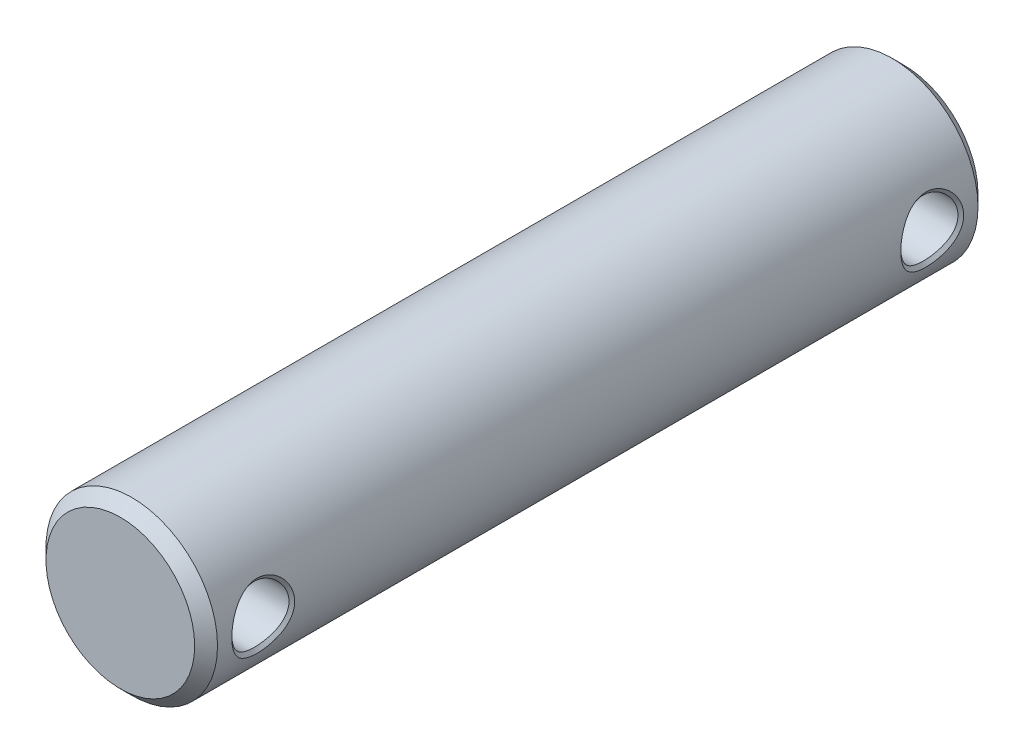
ISO-10303-21;
HEADER;
FILE_DESCRIPTION(('STEP AP214'),'2;1');
FILE_NAME('part.step','',(''),(''),'','','');
FILE_SCHEMA(('AUTOMOTIVE_DESIGN { 1 0 10303 214 1 1 1 1 }'));
ENDSEC;
DATA;
#1=APPLICATION_CONTEXT('core data for automotive mechanical design processes');
#2=APPLICATION_PROTOCOL_DEFINITION('international standard','automotive_design',2000,#1);
#3=PRODUCT_CONTEXT('',#1,'mechanical');
#4=PRODUCT('Part','Part','',(#3));
#5=PRODUCT_RELATED_PRODUCT_CATEGORY('part','',(#4));
#6=PRODUCT_DEFINITION_FORMATION('','',#4);
#7=PRODUCT_DEFINITION_CONTEXT('part definition',#1,'design');
#8=PRODUCT_DEFINITION('design','',#6,#7);
#9=PRODUCT_DEFINITION_SHAPE('','',#8);
#10=(LENGTH_UNIT() NAMED_UNIT(*) SI_UNIT(.MILLI.,.METRE.));
#11=(NAMED_UNIT(*) PLANE_ANGLE_UNIT() SI_UNIT($,.RADIAN.));
#12=(NAMED_UNIT(*) SI_UNIT($,.STERADIAN.) SOLID_ANGLE_UNIT());
#13=UNCERTAINTY_MEASURE_WITH_UNIT(LENGTH_MEASURE(1.E-05),#10,'distance_accuracy_value','');
#14=(GEOMETRIC_REPRESENTATION_CONTEXT(3) GLOBAL_UNCERTAINTY_ASSIGNED_CONTEXT((#13)) GLOBAL_UNIT_ASSIGNED_CONTEXT((#10,
#11,#12)) REPRESENTATION_CONTEXT('',''));
#15=CARTESIAN_POINT('',(0.,0.,0.));
#16=DIRECTION('',(0.,0.,1.));
#17=DIRECTION('',(1.,0.,0.));
#18=AXIS2_PLACEMENT_3D('',#15,#16,#17);
#19=CARTESIAN_POINT('',(0.,0.,137.));
#20=DIRECTION('',(0.,0.,-1.));
#21=DIRECTION('',(-1.,0.,0.));
#22=AXIS2_PLACEMENT_3D('',#19,#20,#21);
#23=CYLINDRICAL_SURFACE('',#22,15.);
#24=CARTESIAN_POINT('',(-15.,0.,132.499999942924));
#25=CARTESIAN_POINT('',(-14.9999813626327,0.0942102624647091,132.499940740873));
#26=CARTESIAN_POINT('',(-14.9989718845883,0.18841357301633,132.497529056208));
#27=CARTESIAN_POINT('',(-14.9950698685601,0.376327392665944,132.48808421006));
#28=CARTESIAN_POINT('',(-14.9921817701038,0.470038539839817,132.48106194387));
#29=CARTESIAN_POINT('',(-14.9846266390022,0.656774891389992,132.462494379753));
#30=CARTESIAN_POINT('',(-14.9799626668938,0.749800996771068,132.450956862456));
#31=CARTESIAN_POINT('',(-14.9689611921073,0.934978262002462,132.423459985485));
#32=CARTESIAN_POINT('',(-14.96262576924,1.02713036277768,132.407506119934));
#33=CARTESIAN_POINT('',(-14.9483859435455,1.21036976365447,132.37127592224));
#34=CARTESIAN_POINT('',(-14.9404829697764,1.3014579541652,132.351003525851));
#35=CARTESIAN_POINT('',(-14.9232124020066,1.48238000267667,132.306235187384));
#36=CARTESIAN_POINT('',(-14.9138458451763,1.57221470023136,132.281742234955));
#37=CARTESIAN_POINT('',(-14.8937521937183,1.75044012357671,132.228631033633));
#38=CARTESIAN_POINT('',(-14.8830259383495,1.8388317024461,132.200015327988));
#39=CARTESIAN_POINT('',(-14.8603167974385,2.01398117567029,132.138756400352));
#40=CARTESIAN_POINT('',(-14.8483346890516,2.10074004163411,132.106115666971));
#41=CARTESIAN_POINT('',(-14.82321763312,2.27243424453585,132.036904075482));
#42=CARTESIAN_POINT('',(-14.8100834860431,2.35737079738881,132.000335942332));
#43=CARTESIAN_POINT('',(-14.7827660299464,2.52523038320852,131.923366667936));
#44=CARTESIAN_POINT('',(-14.7685835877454,2.60815500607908,131.882968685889));
#45=CARTESIAN_POINT('',(-14.7392733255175,2.77180061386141,131.798436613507));
#46=CARTESIAN_POINT('',(-14.7241464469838,2.85252368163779,131.754306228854));
#47=CARTESIAN_POINT('',(-14.6930505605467,3.01157587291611,131.662406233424));
#48=CARTESIAN_POINT('',(-14.6770825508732,3.08990766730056,131.614640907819));
#49=CARTESIAN_POINT('',(-14.6444096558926,3.243987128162,131.51556754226));
#50=CARTESIAN_POINT('',(-14.6277057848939,3.31973811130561,131.464264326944));
#51=CARTESIAN_POINT('',(-14.5936590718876,3.46846487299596,131.358212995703));
#52=CARTESIAN_POINT('',(-14.5763172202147,3.54144462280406,131.303470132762));
#53=CARTESIAN_POINT('',(-14.5411200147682,3.68444093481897,131.190632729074));
#54=CARTESIAN_POINT('',(-14.5232655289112,3.75446206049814,131.132543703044));
#55=CARTESIAN_POINT('',(-14.4870661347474,3.89134165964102,131.01312486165));
#56=CARTESIAN_POINT('',(-14.468722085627,3.95820516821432,130.951800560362));
#57=CARTESIAN_POINT('',(-14.4319459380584,4.08862078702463,130.825949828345));
#58=CARTESIAN_POINT('',(-14.4135140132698,4.15217772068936,130.761428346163));
#59=CARTESIAN_POINT('',(-14.3769871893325,4.27592160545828,130.629310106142));
#60=CARTESIAN_POINT('',(-14.3588918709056,4.33611296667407,130.561717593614));
#61=CARTESIAN_POINT('',(-14.3230838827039,4.45301567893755,130.423655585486));
#62=CARTESIAN_POINT('',(-14.3053707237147,4.50973167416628,130.353190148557));
#63=CARTESIAN_POINT('',(-14.270474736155,4.61958483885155,130.209562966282));
#64=CARTESIAN_POINT('',(-14.2532911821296,4.672727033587,130.13640524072));
#65=CARTESIAN_POINT('',(-14.2195748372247,4.77533055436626,129.987578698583));
#66=CARTESIAN_POINT('',(-14.2030410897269,4.82479739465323,129.911913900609));
#67=CARTESIAN_POINT('',(-14.1707521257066,4.91994887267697,129.758257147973));
#68=CARTESIAN_POINT('',(-14.1549956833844,4.96563954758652,129.680269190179));
#69=CARTESIAN_POINT('',(-14.1243871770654,5.05313710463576,129.522150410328));
#70=CARTESIAN_POINT('',(-14.1095336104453,5.09495050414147,129.442023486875));
#71=CARTESIAN_POINT('',(-14.0808572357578,5.1745920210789,129.279811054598));
#72=CARTESIAN_POINT('',(-14.0670326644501,5.21242700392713,129.197729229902));
#73=CARTESIAN_POINT('',(-14.0405405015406,5.28401031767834,129.031791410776));
#74=CARTESIAN_POINT('',(-14.0278709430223,5.31776562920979,128.947938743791));
#75=CARTESIAN_POINT('',(-14.003815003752,5.38108846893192,128.778643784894));
#76=CARTESIAN_POINT('',(-13.9924265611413,5.41066274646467,128.693204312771));
#77=CARTESIAN_POINT('',(-13.971058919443,5.46552275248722,128.52092043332));
#78=CARTESIAN_POINT('',(-13.961077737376,5.49081452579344,128.434078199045));
#79=CARTESIAN_POINT('',(-13.94265052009,5.53700919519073,128.259173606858));
#80=CARTESIAN_POINT('',(-13.9342028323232,5.55791681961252,128.17111267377));
#81=CARTESIAN_POINT('',(-13.9189681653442,5.59524366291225,127.993955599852));
#82=CARTESIAN_POINT('',(-13.9121802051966,5.611665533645,127.904860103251));
#83=CARTESIAN_POINT('',(-13.900390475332,5.63992146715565,127.725818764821));
#84=CARTESIAN_POINT('',(-13.895388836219,5.65175519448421,127.635872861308));
#85=CARTESIAN_POINT('',(-13.8872957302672,5.67073879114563,127.455315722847));
#86=CARTESIAN_POINT('',(-13.8842060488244,5.67788428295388,127.364703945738));
#87=CARTESIAN_POINT('',(-13.8800641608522,5.68738736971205,127.182998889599));
#88=CARTESIAN_POINT('',(-13.8790160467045,5.68973534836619,127.091905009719));
#89=CARTESIAN_POINT('',(-13.879069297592,5.6895747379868,126.909728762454));
#90=CARTESIAN_POINT('',(-13.8801705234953,5.68706646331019,126.818646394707));
#91=CARTESIAN_POINT('',(-13.8843977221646,5.67729287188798,126.636982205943));
#92=CARTESIAN_POINT('',(-13.8875193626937,5.67003773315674,126.546399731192));
#93=CARTESIAN_POINT('',(-13.8956634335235,5.65086737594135,126.36591503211));
#94=CARTESIAN_POINT('',(-13.9006838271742,5.63895715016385,126.276012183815));
#95=CARTESIAN_POINT('',(-13.9124983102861,5.61058134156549,126.097066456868));
#96=CARTESIAN_POINT('',(-13.9192920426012,5.5941166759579,126.008023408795));
#97=CARTESIAN_POINT('',(-13.9345277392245,5.55673318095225,125.830976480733));
#98=CARTESIAN_POINT('',(-13.9429704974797,5.53581220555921,125.742973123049));
#99=CARTESIAN_POINT('',(-13.9613790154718,5.4896169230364,125.568184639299));
#100=CARTESIAN_POINT('',(-13.9713462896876,5.46433828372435,125.481400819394));
#101=CARTESIAN_POINT('',(-13.9926790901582,5.40952747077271,125.309230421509));
#102=CARTESIAN_POINT('',(-14.0040465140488,5.3799895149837,125.223845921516));
#103=CARTESIAN_POINT('',(-14.028055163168,5.31675919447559,125.054653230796));
#104=CARTESIAN_POINT('',(-14.0406984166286,5.28306019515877,124.970847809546));
#105=CARTESIAN_POINT('',(-14.0671345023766,5.21160631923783,124.80499245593));
#106=CARTESIAN_POINT('',(-14.0809293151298,5.1738444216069,124.722945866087));
#107=CARTESIAN_POINT('',(-14.1095444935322,5.0943628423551,124.560787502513));
#108=CARTESIAN_POINT('',(-14.1243666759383,5.05263609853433,124.480679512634));
#109=CARTESIAN_POINT('',(-14.1549125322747,4.96532255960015,124.322577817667));
#110=CARTESIAN_POINT('',(-14.1706377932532,4.91972889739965,124.244588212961));
#111=CARTESIAN_POINT('',(-14.2028663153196,4.82477913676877,124.090902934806));
#112=CARTESIAN_POINT('',(-14.2193709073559,4.77541650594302,124.015211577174));
#113=CARTESIAN_POINT('',(-14.2530326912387,4.67302589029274,123.866302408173));
#114=CARTESIAN_POINT('',(-14.2701909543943,4.61999176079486,123.793089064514));
#115=CARTESIAN_POINT('',(-14.3050418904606,4.5103566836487,123.649316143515));
#116=CARTESIAN_POINT('',(-14.3227354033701,4.45374996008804,123.578761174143));
#117=CARTESIAN_POINT('',(-14.3585116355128,4.33706263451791,123.440483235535));
#118=CARTESIAN_POINT('',(-14.3765949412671,4.27697652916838,123.372765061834));
#119=CARTESIAN_POINT('',(-14.4131065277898,4.15344449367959,123.240346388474));
#120=CARTESIAN_POINT('',(-14.4315353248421,4.08999322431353,123.175651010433));
#121=CARTESIAN_POINT('',(-14.4683140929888,3.95977244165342,123.049441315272));
#122=CARTESIAN_POINT('',(-14.4866638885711,3.89299773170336,122.987932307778));
#123=CARTESIAN_POINT('',(-14.5228805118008,3.75626543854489,122.86817588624));
#124=CARTESIAN_POINT('',(-14.540746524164,3.6863029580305,122.809933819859));
#125=CARTESIAN_POINT('',(-14.5759709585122,3.5434026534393,122.696812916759));
#126=CARTESIAN_POINT('',(-14.593328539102,3.47046032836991,122.641939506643));
#127=CARTESIAN_POINT('',(-14.6274099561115,3.32178672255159,122.535650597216));
#128=CARTESIAN_POINT('',(-14.644132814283,3.24605146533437,122.484240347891));
#129=CARTESIAN_POINT('',(-14.6768458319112,3.09198385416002,122.384974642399));
#130=CARTESIAN_POINT('',(-14.6928349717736,3.01364813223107,122.337124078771));
#131=CARTESIAN_POINT('',(-14.7239742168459,2.85456988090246,122.245074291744));
#132=CARTESIAN_POINT('',(-14.7391233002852,2.77382459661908,122.200879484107));
#133=CARTESIAN_POINT('',(-14.7684780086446,2.61011791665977,122.116238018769));
#134=CARTESIAN_POINT('',(-14.7826826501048,2.52715433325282,122.07579525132));
#135=CARTESIAN_POINT('',(-14.8100434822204,2.3592016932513,121.998754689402));
#136=CARTESIAN_POINT('',(-14.823198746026,2.27421093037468,121.962160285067));
#137=CARTESIAN_POINT('',(-14.8483559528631,2.10239468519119,121.892913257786));
#138=CARTESIAN_POINT('',(-14.8603570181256,2.01556786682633,121.860263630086));
#139=CARTESIAN_POINT('',(-14.8831009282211,1.8402703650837,121.799002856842));
#140=CARTESIAN_POINT('',(-14.8938429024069,1.75179859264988,121.770394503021));
#141=CARTESIAN_POINT('',(-14.9139637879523,1.57340215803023,121.717312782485));
#142=CARTESIAN_POINT('',(-14.9233417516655,1.48347653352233,121.692842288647));
#143=CARTESIAN_POINT('',(-14.9406298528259,1.3023634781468,121.648132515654));
#144=CARTESIAN_POINT('',(-14.9485388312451,1.2111751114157,121.627896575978));
#145=CARTESIAN_POINT('',(-14.962784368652,1.02772775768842,121.59175170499));
#146=CARTESIAN_POINT('',(-14.9691193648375,0.935467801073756,121.575847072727));
#147=CARTESIAN_POINT('',(-14.9801124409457,0.750068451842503,121.548460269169));
#148=CARTESIAN_POINT('',(-14.9847682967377,0.656928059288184,121.536983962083));
#149=CARTESIAN_POINT('',(-14.9922992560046,0.469959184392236,121.518548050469));
#150=CARTESIAN_POINT('',(-14.9951711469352,0.376129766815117,121.51159659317));
#151=CARTESIAN_POINT('',(-14.9990292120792,0.187973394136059,121.50230612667));
#152=CARTESIAN_POINT('',(-15.0000107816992,0.0936457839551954,121.499978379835));
#153=CARTESIAN_POINT('',(-14.999989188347,-0.0949994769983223,121.500021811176));
#154=CARTESIAN_POINT('',(-14.998986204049,-0.189317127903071,121.502392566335));
#155=CARTESIAN_POINT('',(-14.9950930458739,-0.377435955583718,121.511757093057));
#156=CARTESIAN_POINT('',(-14.9922077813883,-0.471237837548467,121.51873883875));
#157=CARTESIAN_POINT('',(-14.9846549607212,-0.658136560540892,121.537227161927));
#158=CARTESIAN_POINT('',(-14.9799908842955,-0.751234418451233,121.548724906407));
#159=CARTESIAN_POINT('',(-14.9689863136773,-0.936536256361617,121.576145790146));
#160=CARTESIAN_POINT('',(-14.962648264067,-1.02874133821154,121.592062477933));
#161=CARTESIAN_POINT('',(-14.9484008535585,-1.21206912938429,121.628223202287));
#162=CARTESIAN_POINT('',(-14.9404932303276,-1.30319291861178,121.648462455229));
#163=CARTESIAN_POINT('',(-14.9232115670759,-1.48416965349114,121.693170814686));
#164=CARTESIAN_POINT('',(-14.9138388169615,-1.57402364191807,121.717636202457));
#165=CARTESIAN_POINT('',(-14.8937315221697,-1.75227229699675,121.770699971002));
#166=CARTESIAN_POINT('',(-14.8829980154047,-1.84066801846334,121.79929520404));
#167=CARTESIAN_POINT('',(-14.86027365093,-2.0158115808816,121.860522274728));
#168=CARTESIAN_POINT('',(-14.8482837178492,-2.10256057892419,121.893151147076));
#169=CARTESIAN_POINT('',(-14.8231508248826,-2.27422202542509,121.962349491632));
#170=CARTESIAN_POINT('',(-14.8100087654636,-2.35913584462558,121.998915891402));
#171=CARTESIAN_POINT('',(-14.7826758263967,-2.52693812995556,122.075893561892));
#172=CARTESIAN_POINT('',(-14.7684858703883,-2.60982829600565,122.116301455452));
#173=CARTESIAN_POINT('',(-14.7391614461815,-2.77339436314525,122.200866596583));
#174=CARTESIAN_POINT('',(-14.7240279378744,-2.85407239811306,122.245020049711));
#175=CARTESIAN_POINT('',(-14.6929201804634,-3.01302510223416,122.336980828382));
#176=CARTESIAN_POINT('',(-14.6769469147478,-3.09130241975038,122.384783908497));
#177=CARTESIAN_POINT('',(-14.6442653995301,-3.24526478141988,122.48394876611));
#178=CARTESIAN_POINT('',(-14.6275581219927,-3.32095303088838,122.535305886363));
#179=CARTESIAN_POINT('',(-14.59350703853,-3.46954726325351,122.641482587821));
#180=CARTESIAN_POINT('',(-14.576164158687,-3.54245700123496,122.69629720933));
#181=CARTESIAN_POINT('',(-14.5409676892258,-3.68530810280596,122.809296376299));
#182=CARTESIAN_POINT('',(-14.5231148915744,-3.75525369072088,122.867475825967));
#183=CARTESIAN_POINT('',(-14.4869227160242,-3.89197603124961,122.987097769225));
#184=CARTESIAN_POINT('',(-14.4685841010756,-3.95875734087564,123.04853528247));
#185=CARTESIAN_POINT('',(-14.4318209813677,-4.08901280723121,123.174626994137));
#186=CARTESIAN_POINT('',(-14.4133966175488,-4.15249111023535,123.239276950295));
#187=CARTESIAN_POINT('',(-14.3768842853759,-4.27609210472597,123.371656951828));
#188=CARTESIAN_POINT('',(-14.3587959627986,-4.33621848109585,123.439383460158));
#189=CARTESIAN_POINT('',(-14.3230017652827,-4.45300259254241,123.57771896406));
#190=CARTESIAN_POINT('',(-14.3052954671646,-4.50966430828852,123.648324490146));
#191=CARTESIAN_POINT('',(-14.2704127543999,-4.61942023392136,123.792234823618));
#192=CARTESIAN_POINT('',(-14.2532356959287,-4.67251887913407,123.865536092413));
#193=CARTESIAN_POINT('',(-14.2195318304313,-4.77504576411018,124.014651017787));
#194=CARTESIAN_POINT('',(-14.2030041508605,-4.82447901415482,124.09046103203));
#195=CARTESIAN_POINT('',(-14.1707267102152,-4.91957311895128,124.244407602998));
#196=CARTESIAN_POINT('',(-14.1549758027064,-4.96523960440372,124.322540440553));
#197=CARTESIAN_POINT('',(-14.1243776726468,-5.05269786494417,124.480946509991));
#198=CARTESIAN_POINT('',(-14.1095290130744,-5.09449586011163,124.561216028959));
#199=CARTESIAN_POINT('',(-14.0808616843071,-5.17411492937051,124.723709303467));
#200=CARTESIAN_POINT('',(-14.0670412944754,-5.21194269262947,124.805929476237));
#201=CARTESIAN_POINT('',(-14.040556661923,-5.28351919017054,124.972137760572));
#202=CARTESIAN_POINT('',(-14.0278904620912,-5.3172748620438,125.056122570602));
#203=CARTESIAN_POINT('',(-14.0038403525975,-5.38060529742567,125.225673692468));
#204=CARTESIAN_POINT('',(-13.9924543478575,-5.41018691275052,125.311237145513));
#205=CARTESIAN_POINT('',(-13.9710906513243,-5.46506770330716,125.483758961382));
#206=CARTESIAN_POINT('',(-13.9611108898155,-5.49037318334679,125.570715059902));
#207=CARTESIAN_POINT('',(-13.9426855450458,-5.53660061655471,125.745835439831));
#208=CARTESIAN_POINT('',(-13.9342381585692,-5.55752772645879,125.83399816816));
#209=CARTESIAN_POINT('',(-13.9190031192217,-5.59489804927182,126.01134496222));
#210=CARTESIAN_POINT('',(-13.912214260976,-5.61134451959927,126.1005282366));
#211=CARTESIAN_POINT('',(-13.9004216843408,-5.6396535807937,126.279729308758));
#212=CARTESIAN_POINT('',(-13.8954177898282,-5.65151662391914,126.369747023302));
#213=CARTESIAN_POINT('',(-13.8873193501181,-5.67056118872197,126.550430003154));
#214=CARTESIAN_POINT('',(-13.8842261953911,-5.67773930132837,126.641095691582));
#215=CARTESIAN_POINT('',(-13.8800756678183,-5.68731214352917,126.822888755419));
#216=CARTESIAN_POINT('',(-13.8790218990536,-5.68969840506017,126.914016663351));
#217=CARTESIAN_POINT('',(-13.8790654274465,-5.68960684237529,127.096236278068));
#218=CARTESIAN_POINT('',(-13.880161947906,-5.6871307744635,127.187327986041));
#219=CARTESIAN_POINT('',(-13.8843842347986,-5.67740422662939,127.368983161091));
#220=CARTESIAN_POINT('',(-13.887505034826,-5.67016543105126,127.4595473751));
#221=CARTESIAN_POINT('',(-13.8956504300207,-5.65101540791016,127.639970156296));
#222=CARTESIAN_POINT('',(-13.9006724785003,-5.63911042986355,127.72982950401));
#223=CARTESIAN_POINT('',(-13.9124929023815,-5.61073398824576,127.908665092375));
#224=CARTESIAN_POINT('',(-13.9192905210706,-5.59426446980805,127.997641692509));
#225=CARTESIAN_POINT('',(-13.9345359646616,-5.5568623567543,128.174534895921));
#226=CARTESIAN_POINT('',(-13.9429842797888,-5.53592843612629,128.262451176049));
#227=CARTESIAN_POINT('',(-13.9614053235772,-5.48970027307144,128.437047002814));
#228=CARTESIAN_POINT('',(-13.9713793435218,-5.46440233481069,128.523725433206));
#229=CARTESIAN_POINT('',(-13.9927264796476,-5.40954790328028,128.69566889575));
#230=CARTESIAN_POINT('',(-14.0041013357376,-5.37998610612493,128.780932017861));
#231=CARTESIAN_POINT('',(-14.0281251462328,-5.31670500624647,128.949868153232));
#232=CARTESIAN_POINT('',(-14.0407760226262,-5.28297941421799,129.033538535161));
#233=CARTESIAN_POINT('',(-14.0672271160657,-5.21147116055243,129.199112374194));
#234=CARTESIAN_POINT('',(-14.0810292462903,-5.17368171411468,129.281012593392));
#235=CARTESIAN_POINT('',(-14.1096582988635,-5.09414572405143,129.442869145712));
#236=CARTESIAN_POINT('',(-14.1244869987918,-5.05239226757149,129.522821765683));
#237=CARTESIAN_POINT('',(-14.1550446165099,-4.96502784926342,129.680606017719));
#238=CARTESIAN_POINT('',(-14.1707751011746,-4.91941010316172,129.75843358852));
#239=CARTESIAN_POINT('',(-14.2030122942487,-4.82441655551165,129.911790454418));
#240=CARTESIAN_POINT('',(-14.2195203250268,-4.77503425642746,129.987315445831));
#241=CARTESIAN_POINT('',(-14.2531867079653,-4.67261051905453,130.135889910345));
#242=CARTESIAN_POINT('',(-14.2703461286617,-4.61956294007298,130.208934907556));
#243=CARTESIAN_POINT('',(-14.3051966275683,-4.50990893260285,130.352371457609));
#244=CARTESIAN_POINT('',(-14.3228885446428,-4.45329671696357,130.422758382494));
#245=CARTESIAN_POINT('',(-14.3586582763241,-4.3366083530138,130.560703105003));
#246=CARTESIAN_POINT('',(-14.3767366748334,-4.27652668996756,130.62825608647));
#247=CARTESIAN_POINT('',(-14.4132349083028,-4.15301455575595,130.760348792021));
#248=CARTESIAN_POINT('',(-14.4316552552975,-4.08957874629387,130.824883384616));
#249=CARTESIAN_POINT('',(-14.468416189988,-3.95938994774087,130.950795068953));
#250=CARTESIAN_POINT('',(-14.4867565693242,-3.89263108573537,131.012166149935));
#251=CARTESIAN_POINT('',(-14.5229568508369,-3.75592210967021,131.131685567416));
#252=CARTESIAN_POINT('',(-14.540815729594,-3.68596593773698,131.189827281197));
#253=CARTESIAN_POINT('',(-14.5760283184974,-3.54307124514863,131.302781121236));
#254=CARTESIAN_POINT('',(-14.5933810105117,-3.47012733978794,131.357586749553));
#255=CARTESIAN_POINT('',(-14.6274546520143,-3.32144584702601,131.463769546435));
#256=CARTESIAN_POINT('',(-14.6441744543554,-3.24570363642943,131.515140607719));
#257=CARTESIAN_POINT('',(-14.6768830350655,-3.09161947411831,131.614352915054));
#258=CARTESIAN_POINT('',(-14.6928706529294,-3.01327371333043,131.662188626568));
#259=CARTESIAN_POINT('',(-14.7240081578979,-2.85417491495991,131.754229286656));
#260=CARTESIAN_POINT('',(-14.7391569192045,-2.77341885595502,131.798429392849));
#261=CARTESIAN_POINT('',(-14.7685119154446,-2.60969234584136,131.883097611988));
#262=CARTESIAN_POINT('',(-14.7827171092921,-2.52671958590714,131.923561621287));
#263=CARTESIAN_POINT('',(-14.8100795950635,-2.35875253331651,132.000656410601));
#264=CARTESIAN_POINT('',(-14.8232359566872,-2.27375653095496,132.037283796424));
#265=CARTESIAN_POINT('',(-14.8483955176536,-2.10193599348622,132.10660411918));
#266=CARTESIAN_POINT('',(-14.860397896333,-2.01511020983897,132.139294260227));
#267=CARTESIAN_POINT('',(-14.883144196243,-1.83982323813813,132.200638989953));
#268=CARTESIAN_POINT('',(-14.8938873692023,-1.75136111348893,132.229291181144));
#269=CARTESIAN_POINT('',(-14.9140100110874,-1.57299472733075,132.282459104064));
#270=CARTESIAN_POINT('',(-14.9233887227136,-1.48308969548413,132.306972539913));
#271=CARTESIAN_POINT('',(-14.9406772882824,-1.30203091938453,132.351762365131));
#272=CARTESIAN_POINT('',(-14.9485862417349,-1.21087644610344,132.372036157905));
#273=CARTESIAN_POINT('',(-14.9628302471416,-1.02751224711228,132.408246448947));
#274=CARTESIAN_POINT('',(-14.969164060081,-0.935301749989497,132.424179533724));
#275=CARTESIAN_POINT('',(-14.9801530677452,-0.750019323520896,132.45160894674));
#276=CARTESIAN_POINT('',(-14.9848064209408,-0.656946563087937,132.463100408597));
#277=CARTESIAN_POINT('',(-14.9923296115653,-0.470132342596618,132.481546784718));
#278=CARTESIAN_POINT('',(-14.9951966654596,-0.376390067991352,132.488494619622));
#279=CARTESIAN_POINT('',(-14.9990444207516,-0.188433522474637,132.497758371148));
#280=CARTESIAN_POINT('',(-15.0000209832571,-0.094218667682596,132.500064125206));
#281=CARTESIAN_POINT('',(-15.,0.,132.499999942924));
#282=B_SPLINE_CURVE_WITH_KNOTS('',3,(#24,#25,#26,#27,#28,#29,#30,#31,#32,#33,#34,#35,#36,#37,
#38,#39,#40,#41,#42,#43,#44,#45,#46,#47,#48,#49,#50,#51,#52,#53,#54,#55,#56,#57,#58,#59,#60,#61,
#62,#63,#64,#65,#66,#67,#68,#69,#70,#71,#72,#73,#74,#75,#76,#77,#78,#79,#80,#81,#82,#83,#84,#85,
#86,#87,#88,#89,#90,#91,#92,#93,#94,#95,#96,#97,#98,#99,#100,#101,#102,#103,#104,#105,#106,#107,
#108,#109,#110,#111,#112,#113,#114,#115,#116,#117,#118,#119,#120,#121,#122,#123,#124,#125,#126,
#127,#128,#129,#130,#131,#132,#133,#134,#135,#136,#137,#138,#139,#140,#141,#142,#143,#144,#145,
#146,#147,#148,#149,#150,#151,#152,#153,#154,#155,#156,#157,#158,#159,#160,#161,#162,#163,#164,
#165,#166,#167,#168,#169,#170,#171,#172,#173,#174,#175,#176,#177,#178,#179,#180,#181,#182,#183,
#184,#185,#186,#187,#188,#189,#190,#191,#192,#193,#194,#195,#196,#197,#198,#199,#200,#201,#202,
#203,#204,#205,#206,#207,#208,#209,#210,#211,#212,#213,#214,#215,#216,#217,#218,#219,#220,#221,
#222,#223,#224,#225,#226,#227,#228,#229,#230,#231,#232,#233,#234,#235,#236,#237,#238,#239,#240,
#241,#242,#243,#244,#245,#246,#247,#248,#249,#250,#251,#252,#253,#254,#255,#256,#257,#258,#259,
#260,#261,#262,#263,#264,#265,#266,#267,#268,#269,#270,#271,#272,#273,#274,#275,#276,#277,#278,
#279,#280,#281),.UNSPECIFIED.,.F.,.F.,(4,2,2,2,2,2,2,2,2,2,2,2,2,2,2,2,2,2,2,2,2,2,2,2,2,2,2,2,
2,2,2,2,2,2,2,2,2,2,2,2,2,2,2,2,2,2,2,2,2,2,2,2,2,2,2,2,2,2,2,2,2,2,2,2,2,2,2,2,2,2,2,2,2,2,2,2,
2,2,2,2,2,2,2,2,2,2,2,2,2,2,2,2,2,2,2,2,2,2,2,2,2,2,2,2,2,2,2,2,2,2,2,2,2,2,2,2,2,2,2,2,2,2,2,2,
2,2,2,2,4),(0.,0.282588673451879,0.56451195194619,0.845951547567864,1.12704258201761,
1.40787852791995,1.68851635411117,1.96898179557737,2.24927469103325,2.52937435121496,
2.80924493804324,3.08884084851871,3.36811210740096,3.64700977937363,3.92549141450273,
4.2035265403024,4.48110220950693,4.75826091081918,5.03504748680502,5.31145573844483,
5.58746682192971,5.86305506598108,6.1381938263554,6.41286138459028,6.68704689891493,
6.9607564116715,7.23401890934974,7.50689241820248,7.77947010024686,8.0518862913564,
8.32432239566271,8.59701251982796,8.87024869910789,9.14346719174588,9.41610177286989,
9.68844474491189,9.96073291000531,10.2331524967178,10.5058444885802,10.778910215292,
11.0524170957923,11.3264044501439,11.6008893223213,11.8758722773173,12.1513431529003,
12.4272867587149,12.7036885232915,12.9805400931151,13.257844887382,13.5355978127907,
13.8137928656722,14.0924249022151,14.3714702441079,14.6508922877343,14.9306470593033,
15.2106887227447,15.490975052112,15.7714728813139,16.0521635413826,16.3330482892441,
16.6141537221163,16.8955371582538,17.1772919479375,17.4595526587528,17.7425000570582,
18.0254219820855,18.3076089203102,18.5892466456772,18.8704753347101,19.1513943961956,
19.4320675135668,19.7125278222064,19.9927831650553,20.2728213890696,20.5526156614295,
20.8321297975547,21.111323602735,21.3901582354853,21.6686016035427,21.9466338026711,
22.2242526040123,22.5015140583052,22.7784644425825,23.0550904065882,23.3313653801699,
23.6072554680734,23.8827253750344,24.1577443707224,24.4322923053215,24.7063656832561,
24.9799837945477,25.2531948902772,25.5260823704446,25.7987709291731,26.0714325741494,
26.3442924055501,26.6176340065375,26.8908768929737,27.1634519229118,27.4356631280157,
27.7077585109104,27.9799348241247,28.2523427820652,28.5250925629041,28.7982594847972,
29.0718897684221,29.3460063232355,29.620614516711,29.8957079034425,30.171273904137,
30.4472994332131,30.7237764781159,31.0007076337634,31.2781469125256,31.5561356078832,
31.8346494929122,32.1136461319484,32.39307066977,32.6728615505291,32.9529561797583,
33.2332965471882,33.5138348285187,33.7945389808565,34.0753983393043,34.356429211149,
34.6376804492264,34.9192389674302,35.2012351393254,35.4838479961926),.UNSPECIFIED.);
#283=CARTESIAN_POINT('',(-15.,0.,132.499999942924));
#284=VERTEX_POINT('',#283);
#285=EDGE_CURVE('E54',#284,#284,#282,.F.);
#286=ORIENTED_EDGE('',*,*,#285,.T.);
#287=EDGE_LOOP('',(#286));
#288=FACE_BOUND('',#287,.T.);
#289=CARTESIAN_POINT('',(15.,0.,121.500000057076));
#290=CARTESIAN_POINT('',(14.9999813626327,0.0942102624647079,121.500059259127));
#291=CARTESIAN_POINT('',(14.9989718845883,0.188413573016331,121.502470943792));
#292=CARTESIAN_POINT('',(14.9950698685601,0.376327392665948,121.51191578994));
#293=CARTESIAN_POINT('',(14.9921817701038,0.470038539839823,121.51893805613));
#294=CARTESIAN_POINT('',(14.9846266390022,0.656774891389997,121.537505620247));
#295=CARTESIAN_POINT('',(14.9799626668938,0.749800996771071,121.549043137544));
#296=CARTESIAN_POINT('',(14.9689611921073,0.934978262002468,121.576540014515));
#297=CARTESIAN_POINT('',(14.96262576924,1.02713036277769,121.592493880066));
#298=CARTESIAN_POINT('',(14.9483859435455,1.21036976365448,121.62872407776));
#299=CARTESIAN_POINT('',(14.9404829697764,1.30145795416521,121.648996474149));
#300=CARTESIAN_POINT('',(14.9232124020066,1.48238000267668,121.693764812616));
#301=CARTESIAN_POINT('',(14.9138458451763,1.57221470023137,121.718257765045));
#302=CARTESIAN_POINT('',(14.8937521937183,1.75044012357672,121.771368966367));
#303=CARTESIAN_POINT('',(14.8830259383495,1.83883170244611,121.799984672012));
#304=CARTESIAN_POINT('',(14.8603167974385,2.01398117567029,121.861243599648));
#305=CARTESIAN_POINT('',(14.8483346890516,2.10074004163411,121.893884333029));
#306=CARTESIAN_POINT('',(14.82321763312,2.27243424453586,121.963095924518));
#307=CARTESIAN_POINT('',(14.8100834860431,2.35737079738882,121.999664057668));
#308=CARTESIAN_POINT('',(14.7827660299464,2.52523038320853,122.076633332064));
#309=CARTESIAN_POINT('',(14.7685835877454,2.60815500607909,122.117031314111));
#310=CARTESIAN_POINT('',(14.7392733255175,2.77180061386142,122.201563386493));
#311=CARTESIAN_POINT('',(14.7241464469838,2.8525236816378,122.245693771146));
#312=CARTESIAN_POINT('',(14.6930505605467,3.01157587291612,122.337593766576));
#313=CARTESIAN_POINT('',(14.6770825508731,3.08990766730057,122.385359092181));
#314=CARTESIAN_POINT('',(14.6444096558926,3.24398712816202,122.48443245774));
#315=CARTESIAN_POINT('',(14.6277057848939,3.31973811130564,122.535735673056));
#316=CARTESIAN_POINT('',(14.5936590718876,3.46846487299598,122.641787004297));
#317=CARTESIAN_POINT('',(14.5763172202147,3.54144462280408,122.696529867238));
#318=CARTESIAN_POINT('',(14.5411200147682,3.68444093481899,122.809367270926));
#319=CARTESIAN_POINT('',(14.5232655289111,3.75446206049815,122.867456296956));
#320=CARTESIAN_POINT('',(14.4870661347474,3.89134165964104,122.98687513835));
#321=CARTESIAN_POINT('',(14.468722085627,3.95820516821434,123.048199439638));
#322=CARTESIAN_POINT('',(14.4319459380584,4.08862078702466,123.174050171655));
#323=CARTESIAN_POINT('',(14.4135140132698,4.15217772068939,123.238571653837));
#324=CARTESIAN_POINT('',(14.3769871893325,4.27592160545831,123.370689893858));
#325=CARTESIAN_POINT('',(14.3588918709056,4.3361129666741,123.438282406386));
#326=CARTESIAN_POINT('',(14.3230838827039,4.45301567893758,123.576344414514));
#327=CARTESIAN_POINT('',(14.3053707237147,4.50973167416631,123.646809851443));
#328=CARTESIAN_POINT('',(14.2704747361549,4.61958483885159,123.790437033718));
#329=CARTESIAN_POINT('',(14.2532911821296,4.67272703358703,123.86359475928));
#330=CARTESIAN_POINT('',(14.2195748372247,4.77533055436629,124.012421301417));
#331=CARTESIAN_POINT('',(14.2030410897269,4.82479739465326,124.088086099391));
#332=CARTESIAN_POINT('',(14.1707521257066,4.91994887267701,124.241742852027));
#333=CARTESIAN_POINT('',(14.1549956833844,4.96563954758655,124.319730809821));
#334=CARTESIAN_POINT('',(14.1243871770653,5.05313710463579,124.477849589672));
#335=CARTESIAN_POINT('',(14.1095336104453,5.0949505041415,124.557976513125));
#336=CARTESIAN_POINT('',(14.0808572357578,5.17459202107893,124.720188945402));
#337=CARTESIAN_POINT('',(14.0670326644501,5.21242700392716,124.802270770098));
#338=CARTESIAN_POINT('',(14.0405405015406,5.28401031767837,124.968208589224));
#339=CARTESIAN_POINT('',(14.0278709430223,5.31776562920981,125.052061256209));
#340=CARTESIAN_POINT('',(14.003815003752,5.38108846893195,125.221356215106));
#341=CARTESIAN_POINT('',(13.9924265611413,5.4106627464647,125.306795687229));
#342=CARTESIAN_POINT('',(13.971058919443,5.46552275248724,125.47907956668));
#343=CARTESIAN_POINT('',(13.961077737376,5.49081452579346,125.565921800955));
#344=CARTESIAN_POINT('',(13.94265052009,5.53700919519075,125.740826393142));
#345=CARTESIAN_POINT('',(13.9342028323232,5.55791681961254,125.82888732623));
#346=CARTESIAN_POINT('',(13.9189681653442,5.59524366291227,126.006044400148));
#347=CARTESIAN_POINT('',(13.9121802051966,5.61166553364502,126.095139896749));
#348=CARTESIAN_POINT('',(13.900390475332,5.63992146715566,126.274181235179));
#349=CARTESIAN_POINT('',(13.895388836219,5.65175519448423,126.364127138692));
#350=CARTESIAN_POINT('',(13.8872957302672,5.67073879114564,126.544684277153));
#351=CARTESIAN_POINT('',(13.8842060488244,5.67788428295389,126.635296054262));
#352=CARTESIAN_POINT('',(13.8800641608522,5.68738736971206,126.817001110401));
#353=CARTESIAN_POINT('',(13.8790160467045,5.6897353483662,126.908094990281));
#354=CARTESIAN_POINT('',(13.879069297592,5.68957473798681,127.090271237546));
#355=CARTESIAN_POINT('',(13.8801705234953,5.6870664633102,127.181353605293));
#356=CARTESIAN_POINT('',(13.8843977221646,5.67729287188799,127.363017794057));
#357=CARTESIAN_POINT('',(13.8875193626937,5.67003773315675,127.453600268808));
#358=CARTESIAN_POINT('',(13.8956634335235,5.65086737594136,127.63408496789));
#359=CARTESIAN_POINT('',(13.9006838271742,5.63895715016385,127.723987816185));
#360=CARTESIAN_POINT('',(13.9124983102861,5.6105813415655,127.902933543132));
#361=CARTESIAN_POINT('',(13.9192920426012,5.59411667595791,127.991976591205));
#362=CARTESIAN_POINT('',(13.9345277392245,5.55673318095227,128.169023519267));
#363=CARTESIAN_POINT('',(13.9429704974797,5.53581220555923,128.257026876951));
#364=CARTESIAN_POINT('',(13.9613790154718,5.48961692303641,128.431815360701));
#365=CARTESIAN_POINT('',(13.9713462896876,5.46433828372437,128.518599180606));
#366=CARTESIAN_POINT('',(13.9926790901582,5.40952747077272,128.690769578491));
#367=CARTESIAN_POINT('',(14.0040465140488,5.37998951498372,128.776154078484));
#368=CARTESIAN_POINT('',(14.028055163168,5.3167591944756,128.945346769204));
#369=CARTESIAN_POINT('',(14.0406984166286,5.28306019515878,129.029152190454));
#370=CARTESIAN_POINT('',(14.0671345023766,5.21160631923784,129.19500754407));
#371=CARTESIAN_POINT('',(14.0809293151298,5.17384442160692,129.277054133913));
#372=CARTESIAN_POINT('',(14.1095444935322,5.09436284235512,129.439212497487));
#373=CARTESIAN_POINT('',(14.1243666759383,5.05263609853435,129.519320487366));
#374=CARTESIAN_POINT('',(14.1549125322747,4.96532255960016,129.677422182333));
#375=CARTESIAN_POINT('',(14.1706377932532,4.91972889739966,129.755411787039));
#376=CARTESIAN_POINT('',(14.2028663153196,4.82477913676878,129.909097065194));
#377=CARTESIAN_POINT('',(14.2193709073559,4.77541650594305,129.984788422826));
#378=CARTESIAN_POINT('',(14.2530326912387,4.67302589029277,130.133697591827));
#379=CARTESIAN_POINT('',(14.2701909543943,4.61999176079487,130.206910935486));
#380=CARTESIAN_POINT('',(14.3050418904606,4.51035668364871,130.350683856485));
#381=CARTESIAN_POINT('',(14.3227354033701,4.45374996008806,130.421238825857));
#382=CARTESIAN_POINT('',(14.3585116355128,4.33706263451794,130.559516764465));
#383=CARTESIAN_POINT('',(14.3765949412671,4.2769765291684,130.627234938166));
#384=CARTESIAN_POINT('',(14.4131065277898,4.15344449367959,130.759653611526));
#385=CARTESIAN_POINT('',(14.4315353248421,4.08999322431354,130.824348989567));
#386=CARTESIAN_POINT('',(14.4683140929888,3.95977244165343,130.950558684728));
#387=CARTESIAN_POINT('',(14.4866638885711,3.89299773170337,131.012067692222));
#388=CARTESIAN_POINT('',(14.5228805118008,3.7562654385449,131.13182411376));
#389=CARTESIAN_POINT('',(14.540746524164,3.68630295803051,131.190066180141));
#390=CARTESIAN_POINT('',(14.5759709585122,3.5434026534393,131.303187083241));
#391=CARTESIAN_POINT('',(14.593328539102,3.47046032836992,131.358060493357));
#392=CARTESIAN_POINT('',(14.6274099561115,3.3217867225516,131.464349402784));
#393=CARTESIAN_POINT('',(14.644132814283,3.24605146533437,131.515759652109));
#394=CARTESIAN_POINT('',(14.6768458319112,3.09198385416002,131.615025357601));
#395=CARTESIAN_POINT('',(14.6928349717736,3.01364813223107,131.662875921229));
#396=CARTESIAN_POINT('',(14.7239742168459,2.85456988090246,131.754925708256));
#397=CARTESIAN_POINT('',(14.7391233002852,2.77382459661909,131.799120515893));
#398=CARTESIAN_POINT('',(14.7684780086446,2.61011791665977,131.883761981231));
#399=CARTESIAN_POINT('',(14.7826826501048,2.52715433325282,131.92420474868));
#400=CARTESIAN_POINT('',(14.8100434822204,2.3592016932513,132.001245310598));
#401=CARTESIAN_POINT('',(14.823198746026,2.27421093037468,132.037839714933));
#402=CARTESIAN_POINT('',(14.8483559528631,2.1023946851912,132.107086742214));
#403=CARTESIAN_POINT('',(14.8603570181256,2.01556786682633,132.139736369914));
#404=CARTESIAN_POINT('',(14.8831009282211,1.84027036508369,132.200997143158));
#405=CARTESIAN_POINT('',(14.8938429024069,1.75179859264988,132.229605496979));
#406=CARTESIAN_POINT('',(14.9139637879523,1.57340215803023,132.282687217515));
#407=CARTESIAN_POINT('',(14.9233417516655,1.48347653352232,132.307157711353));
#408=CARTESIAN_POINT('',(14.9406298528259,1.3023634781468,132.351867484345));
#409=CARTESIAN_POINT('',(14.9485388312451,1.2111751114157,132.372103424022));
#410=CARTESIAN_POINT('',(14.962784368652,1.02772775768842,132.40824829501));
#411=CARTESIAN_POINT('',(14.9691193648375,0.935467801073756,132.424152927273));
#412=CARTESIAN_POINT('',(14.9801124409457,0.750068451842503,132.451539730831));
#413=CARTESIAN_POINT('',(14.9847682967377,0.656928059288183,132.463016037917));
#414=CARTESIAN_POINT('',(14.9922992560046,0.469959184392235,132.481451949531));
#415=CARTESIAN_POINT('',(14.9951711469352,0.376129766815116,132.48840340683));
#416=CARTESIAN_POINT('',(14.9990292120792,0.187973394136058,132.497693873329));
#417=CARTESIAN_POINT('',(15.0000107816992,0.0936457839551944,132.500021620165));
#418=CARTESIAN_POINT('',(14.999989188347,-0.0949994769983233,132.499978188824));
#419=CARTESIAN_POINT('',(14.998986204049,-0.189317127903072,132.497607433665));
#420=CARTESIAN_POINT('',(14.9950930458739,-0.377435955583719,132.488242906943));
#421=CARTESIAN_POINT('',(14.9922077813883,-0.47123783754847,132.48126116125));
#422=CARTESIAN_POINT('',(14.9846549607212,-0.658136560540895,132.462772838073));
#423=CARTESIAN_POINT('',(14.9799908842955,-0.751234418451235,132.451275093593));
#424=CARTESIAN_POINT('',(14.9689863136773,-0.936536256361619,132.423854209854));
#425=CARTESIAN_POINT('',(14.962648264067,-1.02874133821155,132.407937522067));
#426=CARTESIAN_POINT('',(14.9484008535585,-1.21206912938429,132.371776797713));
#427=CARTESIAN_POINT('',(14.9404932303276,-1.30319291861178,132.351537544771));
#428=CARTESIAN_POINT('',(14.9232115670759,-1.48416965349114,132.306829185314));
#429=CARTESIAN_POINT('',(14.9138388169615,-1.57402364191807,132.282363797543));
#430=CARTESIAN_POINT('',(14.8937315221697,-1.75227229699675,132.229300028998));
#431=CARTESIAN_POINT('',(14.8829980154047,-1.84066801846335,132.20070479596));
#432=CARTESIAN_POINT('',(14.86027365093,-2.01581158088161,132.139477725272));
#433=CARTESIAN_POINT('',(14.8482837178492,-2.10256057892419,132.106848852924));
#434=CARTESIAN_POINT('',(14.8231508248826,-2.2742220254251,132.037650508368));
#435=CARTESIAN_POINT('',(14.8100087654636,-2.35913584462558,132.001084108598));
#436=CARTESIAN_POINT('',(14.7826758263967,-2.52693812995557,131.924106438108));
#437=CARTESIAN_POINT('',(14.7684858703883,-2.60982829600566,131.883698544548));
#438=CARTESIAN_POINT('',(14.7391614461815,-2.77339436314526,131.799133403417));
#439=CARTESIAN_POINT('',(14.7240279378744,-2.85407239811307,131.754979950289));
#440=CARTESIAN_POINT('',(14.6929201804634,-3.01302510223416,131.663019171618));
#441=CARTESIAN_POINT('',(14.6769469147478,-3.09130241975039,131.615216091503));
#442=CARTESIAN_POINT('',(14.6442653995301,-3.2452647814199,131.51605123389));
#443=CARTESIAN_POINT('',(14.6275581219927,-3.3209530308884,131.464694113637));
#444=CARTESIAN_POINT('',(14.59350703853,-3.46954726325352,131.358517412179));
#445=CARTESIAN_POINT('',(14.576164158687,-3.54245700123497,131.30370279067));
#446=CARTESIAN_POINT('',(14.5409676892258,-3.68530810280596,131.190703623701));
#447=CARTESIAN_POINT('',(14.5231148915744,-3.75525369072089,131.132524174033));
#448=CARTESIAN_POINT('',(14.4869227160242,-3.89197603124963,131.012902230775));
#449=CARTESIAN_POINT('',(14.4685841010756,-3.95875734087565,130.95146471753));
#450=CARTESIAN_POINT('',(14.4318209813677,-4.08901280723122,130.825373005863));
#451=CARTESIAN_POINT('',(14.4133966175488,-4.15249111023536,130.760723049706));
#452=CARTESIAN_POINT('',(14.3768842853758,-4.27609210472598,130.628343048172));
#453=CARTESIAN_POINT('',(14.3587959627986,-4.33621848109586,130.560616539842));
#454=CARTESIAN_POINT('',(14.3230017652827,-4.45300259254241,130.42228103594));
#455=CARTESIAN_POINT('',(14.3052954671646,-4.50966430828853,130.351675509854));
#456=CARTESIAN_POINT('',(14.2704127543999,-4.61942023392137,130.207765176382));
#457=CARTESIAN_POINT('',(14.2532356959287,-4.67251887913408,130.134463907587));
#458=CARTESIAN_POINT('',(14.2195318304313,-4.77504576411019,129.985348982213));
#459=CARTESIAN_POINT('',(14.2030041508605,-4.82447901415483,129.90953896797));
#460=CARTESIAN_POINT('',(14.1707267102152,-4.91957311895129,129.755592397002));
#461=CARTESIAN_POINT('',(14.1549758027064,-4.96523960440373,129.677459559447));
#462=CARTESIAN_POINT('',(14.1243776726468,-5.05269786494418,129.519053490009));
#463=CARTESIAN_POINT('',(14.1095290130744,-5.09449586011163,129.438783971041));
#464=CARTESIAN_POINT('',(14.0808616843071,-5.17411492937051,129.276290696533));
#465=CARTESIAN_POINT('',(14.0670412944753,-5.21194269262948,129.194070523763));
#466=CARTESIAN_POINT('',(14.040556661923,-5.28351919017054,129.027862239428));
#467=CARTESIAN_POINT('',(14.0278904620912,-5.3172748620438,128.943877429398));
#468=CARTESIAN_POINT('',(14.0038403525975,-5.38060529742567,128.774326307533));
#469=CARTESIAN_POINT('',(13.9924543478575,-5.41018691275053,128.688762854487));
#470=CARTESIAN_POINT('',(13.9710906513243,-5.46506770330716,128.516241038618));
#471=CARTESIAN_POINT('',(13.9611108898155,-5.4903731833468,128.429284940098));
#472=CARTESIAN_POINT('',(13.9426855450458,-5.53660061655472,128.254164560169));
#473=CARTESIAN_POINT('',(13.9342381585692,-5.5575277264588,128.16600183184));
#474=CARTESIAN_POINT('',(13.9190031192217,-5.59489804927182,127.98865503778));
#475=CARTESIAN_POINT('',(13.912214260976,-5.61134451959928,127.8994717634));
#476=CARTESIAN_POINT('',(13.9004216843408,-5.63965358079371,127.720270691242));
#477=CARTESIAN_POINT('',(13.8954177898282,-5.65151662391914,127.630252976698));
#478=CARTESIAN_POINT('',(13.8873193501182,-5.67056118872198,127.449569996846));
#479=CARTESIAN_POINT('',(13.8842261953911,-5.67773930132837,127.358904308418));
#480=CARTESIAN_POINT('',(13.8800756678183,-5.68731214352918,127.177111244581));
#481=CARTESIAN_POINT('',(13.8790218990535,-5.68969840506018,127.085983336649));
#482=CARTESIAN_POINT('',(13.8790654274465,-5.6896068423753,126.903763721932));
#483=CARTESIAN_POINT('',(13.880161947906,-5.68713077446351,126.812672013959));
#484=CARTESIAN_POINT('',(13.8843842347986,-5.6774042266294,126.631016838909));
#485=CARTESIAN_POINT('',(13.887505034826,-5.67016543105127,126.5404526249));
#486=CARTESIAN_POINT('',(13.8956504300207,-5.65101540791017,126.360029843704));
#487=CARTESIAN_POINT('',(13.9006724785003,-5.63911042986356,126.27017049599));
#488=CARTESIAN_POINT('',(13.9124929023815,-5.61073398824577,126.091334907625));
#489=CARTESIAN_POINT('',(13.9192905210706,-5.59426446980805,126.002358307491));
#490=CARTESIAN_POINT('',(13.9345359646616,-5.55686235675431,125.825465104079));
#491=CARTESIAN_POINT('',(13.9429842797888,-5.53592843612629,125.737548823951));
#492=CARTESIAN_POINT('',(13.9614053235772,-5.48970027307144,125.562952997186));
#493=CARTESIAN_POINT('',(13.9713793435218,-5.4644023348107,125.476274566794));
#494=CARTESIAN_POINT('',(13.9927264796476,-5.40954790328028,125.30433110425));
#495=CARTESIAN_POINT('',(14.0041013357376,-5.37998610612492,125.219067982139));
#496=CARTESIAN_POINT('',(14.0281251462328,-5.31670500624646,125.050131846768));
#497=CARTESIAN_POINT('',(14.0407760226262,-5.28297941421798,124.966461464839));
#498=CARTESIAN_POINT('',(14.0672271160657,-5.21147116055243,124.800887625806));
#499=CARTESIAN_POINT('',(14.0810292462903,-5.17368171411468,124.718987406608));
#500=CARTESIAN_POINT('',(14.1096582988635,-5.09414572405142,124.557130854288));
#501=CARTESIAN_POINT('',(14.1244869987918,-5.05239226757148,124.477178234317));
#502=CARTESIAN_POINT('',(14.1550446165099,-4.96502784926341,124.319393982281));
#503=CARTESIAN_POINT('',(14.1707751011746,-4.91941010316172,124.24156641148));
#504=CARTESIAN_POINT('',(14.2030122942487,-4.82441655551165,124.088209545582));
#505=CARTESIAN_POINT('',(14.2195203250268,-4.77503425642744,124.012684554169));
#506=CARTESIAN_POINT('',(14.2531867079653,-4.67261051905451,123.864110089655));
#507=CARTESIAN_POINT('',(14.2703461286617,-4.61956294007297,123.791065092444));
#508=CARTESIAN_POINT('',(14.3051966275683,-4.50990893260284,123.647628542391));
#509=CARTESIAN_POINT('',(14.3228885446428,-4.45329671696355,123.577241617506));
#510=CARTESIAN_POINT('',(14.3586582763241,-4.33660835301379,123.439296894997));
#511=CARTESIAN_POINT('',(14.3767366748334,-4.27652668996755,123.37174391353));
#512=CARTESIAN_POINT('',(14.4132349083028,-4.15301455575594,123.239651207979));
#513=CARTESIAN_POINT('',(14.4316552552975,-4.08957874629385,123.175116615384));
#514=CARTESIAN_POINT('',(14.468416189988,-3.95938994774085,123.049204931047));
#515=CARTESIAN_POINT('',(14.4867565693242,-3.89263108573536,122.987833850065));
#516=CARTESIAN_POINT('',(14.5229568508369,-3.75592210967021,122.868314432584));
#517=CARTESIAN_POINT('',(14.540815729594,-3.68596593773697,122.810172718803));
#518=CARTESIAN_POINT('',(14.5760283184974,-3.54307124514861,122.697218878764));
#519=CARTESIAN_POINT('',(14.5933810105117,-3.47012733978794,122.642413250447));
#520=CARTESIAN_POINT('',(14.6274546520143,-3.321445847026,122.536230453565));
#521=CARTESIAN_POINT('',(14.6441744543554,-3.24570363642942,122.484859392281));
#522=CARTESIAN_POINT('',(14.6768830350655,-3.0916194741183,122.385647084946));
#523=CARTESIAN_POINT('',(14.6928706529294,-3.01327371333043,122.337811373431));
#524=CARTESIAN_POINT('',(14.7240081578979,-2.8541749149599,122.245770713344));
#525=CARTESIAN_POINT('',(14.7391569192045,-2.77341885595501,122.201570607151));
#526=CARTESIAN_POINT('',(14.7685119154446,-2.60969234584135,122.116902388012));
#527=CARTESIAN_POINT('',(14.7827171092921,-2.52671958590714,122.076438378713));
#528=CARTESIAN_POINT('',(14.8100795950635,-2.35875253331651,121.999343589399));
#529=CARTESIAN_POINT('',(14.8232359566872,-2.27375653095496,121.962716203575));
#530=CARTESIAN_POINT('',(14.8483955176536,-2.10193599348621,121.89339588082));
#531=CARTESIAN_POINT('',(14.860397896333,-2.01511020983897,121.860705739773));
#532=CARTESIAN_POINT('',(14.883144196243,-1.83982323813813,121.799361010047));
#533=CARTESIAN_POINT('',(14.8938873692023,-1.75136111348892,121.770708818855));
#534=CARTESIAN_POINT('',(14.9140100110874,-1.57299472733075,121.717540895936));
#535=CARTESIAN_POINT('',(14.9233887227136,-1.48308969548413,121.693027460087));
#536=CARTESIAN_POINT('',(14.9406772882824,-1.30203091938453,121.648237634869));
#537=CARTESIAN_POINT('',(14.9485862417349,-1.21087644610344,121.627963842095));
#538=CARTESIAN_POINT('',(14.9628302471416,-1.02751224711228,121.591753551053));
#539=CARTESIAN_POINT('',(14.969164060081,-0.935301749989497,121.575820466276));
#540=CARTESIAN_POINT('',(14.9801530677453,-0.750019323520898,121.54839105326));
#541=CARTESIAN_POINT('',(14.9848064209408,-0.656946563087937,121.536899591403));
#542=CARTESIAN_POINT('',(14.9923296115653,-0.470132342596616,121.518453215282));
#543=CARTESIAN_POINT('',(14.9951966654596,-0.376390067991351,121.511505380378));
#544=CARTESIAN_POINT('',(14.9990444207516,-0.188433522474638,121.502241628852));
#545=CARTESIAN_POINT('',(15.0000209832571,-0.094218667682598,121.499935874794));
#546=CARTESIAN_POINT('',(15.,0.,121.500000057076));
#547=B_SPLINE_CURVE_WITH_KNOTS('',3,(#289,#290,#291,#292,#293,#294,#295,#296,#297,#298,#299,
#300,#301,#302,#303,#304,#305,#306,#307,#308,#309,#310,#311,#312,#313,#314,#315,#316,#317,#318,
#319,#320,#321,#322,#323,#324,#325,#326,#327,#328,#329,#330,#331,#332,#333,#334,#335,#336,#337,
#338,#339,#340,#341,#342,#343,#344,#345,#346,#347,#348,#349,#350,#351,#352,#353,#354,#355,#356,
#357,#358,#359,#360,#361,#362,#363,#364,#365,#366,#367,#368,#369,#370,#371,#372,#373,#374,#375,
#376,#377,#378,#379,#380,#381,#382,#383,#384,#385,#386,#387,#388,#389,#390,#391,#392,#393,#394,
#395,#396,#397,#398,#399,#400,#401,#402,#403,#404,#405,#406,#407,#408,#409,#410,#411,#412,#413,
#414,#415,#416,#417,#418,#419,#420,#421,#422,#423,#424,#425,#426,#427,#428,#429,#430,#431,#432,
#433,#434,#435,#436,#437,#438,#439,#440,#441,#442,#443,#444,#445,#446,#447,#448,#449,#450,#451,
#452,#453,#454,#455,#456,#457,#458,#459,#460,#461,#462,#463,#464,#465,#466,#467,#468,#469,#470,
#471,#472,#473,#474,#475,#476,#477,#478,#479,#480,#481,#482,#483,#484,#485,#486,#487,#488,#489,
#490,#491,#492,#493,#494,#495,#496,#497,#498,#499,#500,#501,#502,#503,#504,#505,#506,#507,#508,
#509,#510,#511,#512,#513,#514,#515,#516,#517,#518,#519,#520,#521,#522,#523,#524,#525,#526,#527,
#528,#529,#530,#531,#532,#533,#534,#535,#536,#537,#538,#539,#540,#541,#542,#543,#544,#545,#546),
.UNSPECIFIED.,.F.,.F.,(4,2,2,2,2,2,2,2,2,2,2,2,2,2,2,2,2,2,2,2,2,2,2,2,2,2,2,2,2,2,2,2,2,2,2,2,
2,2,2,2,2,2,2,2,2,2,2,2,2,2,2,2,2,2,2,2,2,2,2,2,2,2,2,2,2,2,2,2,2,2,2,2,2,2,2,2,2,2,2,2,2,2,2,2,
2,2,2,2,2,2,2,2,2,2,2,2,2,2,2,2,2,2,2,2,2,2,2,2,2,2,2,2,2,2,2,2,2,2,2,2,2,2,2,2,2,2,2,2,4),(0.,
0.282588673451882,0.56451195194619,0.845951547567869,1.12704258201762,1.40787852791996,
1.68851635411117,1.96898179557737,2.24927469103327,2.52937435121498,2.80924493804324,
3.08884084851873,3.36811210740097,3.64700977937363,3.92549141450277,4.20352654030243,
4.48110220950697,4.75826091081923,5.03504748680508,5.31145573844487,5.58746682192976,
5.86305506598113,6.13819382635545,6.41286138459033,6.68704689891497,6.96075641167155,
7.23401890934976,7.50689241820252,7.77947010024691,8.05188629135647,8.3243223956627,
8.59701251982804,8.87024869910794,9.14346719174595,9.41610177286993,9.6884447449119,
9.96073291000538,10.2331524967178,10.5058444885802,10.778910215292,11.0524170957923,
11.3264044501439,11.6008893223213,11.8758722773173,12.1513431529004,12.4272867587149,
12.7036885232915,12.9805400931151,13.257844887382,13.5355978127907,13.8137928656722,
14.0924249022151,14.3714702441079,14.6508922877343,14.9306470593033,15.2106887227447,
15.490975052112,15.771472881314,16.0521635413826,16.3330482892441,16.6141537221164,
16.8955371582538,17.1772919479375,17.4595526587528,17.7425000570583,18.0254219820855,
18.3076089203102,18.5892466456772,18.8704753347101,19.1513943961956,19.4320675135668,
19.7125278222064,19.9927831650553,20.2728213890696,20.5526156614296,20.8321297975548,
21.111323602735,21.3901582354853,21.6686016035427,21.9466338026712,22.2242526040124,
22.5015140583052,22.7784644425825,23.0550904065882,23.33136538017,23.6072554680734,
23.8827253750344,24.1577443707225,24.4322923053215,24.7063656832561,24.9799837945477,
25.2531948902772,25.5260823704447,25.7987709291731,26.0714325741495,26.3442924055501,
26.6176340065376,26.8908768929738,27.1634519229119,27.4356631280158,27.7077585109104,
27.9799348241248,28.2523427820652,28.5250925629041,28.7982594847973,29.0718897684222,
29.3460063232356,29.6206145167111,29.8957079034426,30.1712739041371,30.4472994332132,
30.7237764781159,31.0007076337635,31.2781469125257,31.5561356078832,31.8346494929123,
32.1136461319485,32.3930706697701,32.6728615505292,32.9529561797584,33.2332965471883,
33.5138348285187,33.7945389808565,34.0753983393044,34.3564292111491,34.6376804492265,
34.9192389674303,35.2012351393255,35.4838479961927),.UNSPECIFIED.);
#548=CARTESIAN_POINT('',(15.,0.,121.500000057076));
#549=VERTEX_POINT('',#548);
#550=EDGE_CURVE('E59',#549,#549,#547,.F.);
#551=ORIENTED_EDGE('',*,*,#550,.T.);
#552=EDGE_LOOP('',(#551));
#553=FACE_BOUND('',#552,.T.);
#554=CARTESIAN_POINT('',(-15.,0.,15.4999999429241));
#555=CARTESIAN_POINT('',(-14.9999813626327,0.0942102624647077,15.4999407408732));
#556=CARTESIAN_POINT('',(-14.9989718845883,0.188413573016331,15.4975290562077));
#557=CARTESIAN_POINT('',(-14.9950698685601,0.376327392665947,15.4880842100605));
#558=CARTESIAN_POINT('',(-14.9921817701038,0.470038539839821,15.4810619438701));
#559=CARTESIAN_POINT('',(-14.9846266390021,0.656774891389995,15.4624943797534));
#560=CARTESIAN_POINT('',(-14.9799626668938,0.749800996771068,15.4509568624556));
#561=CARTESIAN_POINT('',(-14.9689611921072,0.934978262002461,15.4234599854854));
#562=CARTESIAN_POINT('',(-14.96262576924,1.02713036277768,15.407506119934));
#563=CARTESIAN_POINT('',(-14.9483859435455,1.21036976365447,15.3712759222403));
#564=CARTESIAN_POINT('',(-14.9404829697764,1.3014579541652,15.3510035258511));
#565=CARTESIAN_POINT('',(-14.9232124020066,1.48238000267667,15.3062351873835));
#566=CARTESIAN_POINT('',(-14.9138458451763,1.57221470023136,15.2817422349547));
#567=CARTESIAN_POINT('',(-14.8937521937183,1.75044012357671,15.2286310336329));
#568=CARTESIAN_POINT('',(-14.8830259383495,1.8388317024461,15.2000153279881));
#569=CARTESIAN_POINT('',(-14.8603167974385,2.01398117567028,15.1387564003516));
#570=CARTESIAN_POINT('',(-14.8483346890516,2.1007400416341,15.1061156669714));
#571=CARTESIAN_POINT('',(-14.82321763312,2.27243424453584,15.0369040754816));
#572=CARTESIAN_POINT('',(-14.8100834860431,2.3573707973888,15.0003359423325));
#573=CARTESIAN_POINT('',(-14.7827660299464,2.52523038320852,14.9233666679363));
#574=CARTESIAN_POINT('',(-14.7685835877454,2.60815500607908,14.8829686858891));
#575=CARTESIAN_POINT('',(-14.7392733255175,2.77180061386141,14.7984366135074));
#576=CARTESIAN_POINT('',(-14.7241464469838,2.85252368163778,14.7543062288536));
#577=CARTESIAN_POINT('',(-14.6930505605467,3.0115758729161,14.6624062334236));
#578=CARTESIAN_POINT('',(-14.6770825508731,3.08990766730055,14.6146409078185));
#579=CARTESIAN_POINT('',(-14.6444096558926,3.243987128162,14.51556754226));
#580=CARTESIAN_POINT('',(-14.6277057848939,3.31973811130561,14.4642643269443));
#581=CARTESIAN_POINT('',(-14.5936590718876,3.46846487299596,14.3582129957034));
#582=CARTESIAN_POINT('',(-14.5763172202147,3.54144462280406,14.3034701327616));
#583=CARTESIAN_POINT('',(-14.5411200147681,3.68444093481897,14.1906327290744));
#584=CARTESIAN_POINT('',(-14.5232655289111,3.75446206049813,14.1325437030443));
#585=CARTESIAN_POINT('',(-14.4870661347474,3.89134165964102,14.0131248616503));
#586=CARTESIAN_POINT('',(-14.468722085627,3.95820516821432,13.9518005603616));
#587=CARTESIAN_POINT('',(-14.4319459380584,4.08862078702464,13.8259498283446));
#588=CARTESIAN_POINT('',(-14.4135140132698,4.15217772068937,13.7614283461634));
#589=CARTESIAN_POINT('',(-14.3769871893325,4.27592160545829,13.6293101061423));
#590=CARTESIAN_POINT('',(-14.3588918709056,4.33611296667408,13.5617175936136));
#591=CARTESIAN_POINT('',(-14.3230838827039,4.45301567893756,13.4236555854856));
#592=CARTESIAN_POINT('',(-14.3053707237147,4.50973167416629,13.353190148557));
#593=CARTESIAN_POINT('',(-14.2704747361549,4.61958483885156,13.2095629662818));
#594=CARTESIAN_POINT('',(-14.2532911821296,4.67272703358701,13.1364052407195));
#595=CARTESIAN_POINT('',(-14.2195748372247,4.77533055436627,12.9875786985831));
#596=CARTESIAN_POINT('',(-14.2030410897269,4.82479739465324,12.9119139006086));
#597=CARTESIAN_POINT('',(-14.1707521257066,4.91994887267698,12.7582571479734));
#598=CARTESIAN_POINT('',(-14.1549956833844,4.96563954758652,12.6802691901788));
#599=CARTESIAN_POINT('',(-14.1243871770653,5.05313710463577,12.522150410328));
#600=CARTESIAN_POINT('',(-14.1095336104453,5.09495050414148,12.4420234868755));
#601=CARTESIAN_POINT('',(-14.0808572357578,5.17459202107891,12.2798110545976));
#602=CARTESIAN_POINT('',(-14.0670326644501,5.21242700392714,12.1977292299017));
#603=CARTESIAN_POINT('',(-14.0405405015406,5.28401031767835,12.0317914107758));
#604=CARTESIAN_POINT('',(-14.0278709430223,5.31776562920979,11.9479387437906));
#605=CARTESIAN_POINT('',(-14.003815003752,5.38108846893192,11.7786437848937));
#606=CARTESIAN_POINT('',(-13.9924265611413,5.41066274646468,11.6932043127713));
#607=CARTESIAN_POINT('',(-13.971058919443,5.46552275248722,11.5209204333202));
#608=CARTESIAN_POINT('',(-13.961077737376,5.49081452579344,11.4340781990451));
#609=CARTESIAN_POINT('',(-13.94265052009,5.53700919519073,11.2591736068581));
#610=CARTESIAN_POINT('',(-13.9342028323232,5.55791681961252,11.1711126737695));
#611=CARTESIAN_POINT('',(-13.9189681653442,5.59524366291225,10.9939555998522));
#612=CARTESIAN_POINT('',(-13.9121802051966,5.611665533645,10.904860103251));
#613=CARTESIAN_POINT('',(-13.900390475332,5.63992146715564,10.7258187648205));
#614=CARTESIAN_POINT('',(-13.895388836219,5.65175519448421,10.6358728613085));
#615=CARTESIAN_POINT('',(-13.8872957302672,5.67073879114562,10.455315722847));
#616=CARTESIAN_POINT('',(-13.8842060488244,5.67788428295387,10.3647039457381));
#617=CARTESIAN_POINT('',(-13.8800641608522,5.68738736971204,10.1829988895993));
#618=CARTESIAN_POINT('',(-13.8790160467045,5.68973534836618,10.0919050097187));
#619=CARTESIAN_POINT('',(-13.879069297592,5.68957473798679,9.90972876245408));
#620=CARTESIAN_POINT('',(-13.8801705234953,5.68706646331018,9.81864639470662));
#621=CARTESIAN_POINT('',(-13.8843977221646,5.67729287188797,9.6369822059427));
#622=CARTESIAN_POINT('',(-13.8875193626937,5.67003773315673,9.54639973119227));
#623=CARTESIAN_POINT('',(-13.8956634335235,5.65086737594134,9.36591503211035));
#624=CARTESIAN_POINT('',(-13.9006838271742,5.63895715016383,9.27601218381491));
#625=CARTESIAN_POINT('',(-13.9124983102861,5.61058134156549,9.09706645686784));
#626=CARTESIAN_POINT('',(-13.9192920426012,5.59411667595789,9.0080234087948));
#627=CARTESIAN_POINT('',(-13.9345277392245,5.55673318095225,8.83097648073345));
#628=CARTESIAN_POINT('',(-13.9429704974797,5.5358122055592,8.74297312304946));
#629=CARTESIAN_POINT('',(-13.9613790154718,5.48961692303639,8.56818463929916));
#630=CARTESIAN_POINT('',(-13.9713462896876,5.46433828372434,8.48140081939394));
#631=CARTESIAN_POINT('',(-13.9926790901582,5.4095274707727,8.30923042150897));
#632=CARTESIAN_POINT('',(-14.0040465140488,5.37998951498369,8.22384592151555));
#633=CARTESIAN_POINT('',(-14.028055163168,5.31675919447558,8.05465323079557));
#634=CARTESIAN_POINT('',(-14.0406984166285,5.28306019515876,7.9708478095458));
#635=CARTESIAN_POINT('',(-14.0671345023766,5.21160631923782,7.80499245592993));
#636=CARTESIAN_POINT('',(-14.0809293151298,5.1738444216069,7.7229458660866));
#637=CARTESIAN_POINT('',(-14.1095444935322,5.09436284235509,7.56078750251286));
#638=CARTESIAN_POINT('',(-14.1243666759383,5.05263609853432,7.48067951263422));
#639=CARTESIAN_POINT('',(-14.1549125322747,4.96532255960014,7.32257781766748));
#640=CARTESIAN_POINT('',(-14.1706377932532,4.91972889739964,7.24458821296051));
#641=CARTESIAN_POINT('',(-14.2028663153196,4.82477913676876,7.09090293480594));
#642=CARTESIAN_POINT('',(-14.2193709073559,4.77541650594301,7.01521157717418));
#643=CARTESIAN_POINT('',(-14.2530326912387,4.67302589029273,6.86630240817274));
#644=CARTESIAN_POINT('',(-14.2701909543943,4.61999176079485,6.79308906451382));
#645=CARTESIAN_POINT('',(-14.3050418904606,4.51035668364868,6.64931614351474));
#646=CARTESIAN_POINT('',(-14.3227354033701,4.45374996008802,6.57876117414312));
#647=CARTESIAN_POINT('',(-14.3585116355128,4.3370626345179,6.44048323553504));
#648=CARTESIAN_POINT('',(-14.3765949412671,4.27697652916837,6.37276506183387));
#649=CARTESIAN_POINT('',(-14.4131065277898,4.15344449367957,6.24034638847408));
#650=CARTESIAN_POINT('',(-14.4315353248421,4.08999322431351,6.17565101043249));
#651=CARTESIAN_POINT('',(-14.4683140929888,3.9597724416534,6.0494413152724));
#652=CARTESIAN_POINT('',(-14.4866638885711,3.89299773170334,5.9879323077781));
#653=CARTESIAN_POINT('',(-14.5228805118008,3.75626543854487,5.86817588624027));
#654=CARTESIAN_POINT('',(-14.540746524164,3.68630295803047,5.80993381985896));
#655=CARTESIAN_POINT('',(-14.5759709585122,3.54340265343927,5.6968129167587));
#656=CARTESIAN_POINT('',(-14.593328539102,3.47046032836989,5.64193950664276));
#657=CARTESIAN_POINT('',(-14.6274099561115,3.32178672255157,5.53565059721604));
#658=CARTESIAN_POINT('',(-14.644132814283,3.24605146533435,5.48424034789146));
#659=CARTESIAN_POINT('',(-14.6768458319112,3.09198385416,5.3849746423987));
#660=CARTESIAN_POINT('',(-14.6928349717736,3.01364813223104,5.33712407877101));
#661=CARTESIAN_POINT('',(-14.7239742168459,2.85456988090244,5.24507429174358));
#662=CARTESIAN_POINT('',(-14.7391233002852,2.77382459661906,5.20087948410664));
#663=CARTESIAN_POINT('',(-14.7684780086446,2.61011791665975,5.11623801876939));
#664=CARTESIAN_POINT('',(-14.7826826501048,2.5271543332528,5.07579525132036));
#665=CARTESIAN_POINT('',(-14.8100434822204,2.35920169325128,4.99875468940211));
#666=CARTESIAN_POINT('',(-14.823198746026,2.27421093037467,4.96216028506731));
#667=CARTESIAN_POINT('',(-14.8483559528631,2.10239468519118,4.89291325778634));
#668=CARTESIAN_POINT('',(-14.8603570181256,2.01556786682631,4.86026363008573));
#669=CARTESIAN_POINT('',(-14.8831009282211,1.84027036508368,4.79900285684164));
#670=CARTESIAN_POINT('',(-14.8938429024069,1.75179859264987,4.77039450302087));
#671=CARTESIAN_POINT('',(-14.9139637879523,1.57340215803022,4.71731278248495));
#672=CARTESIAN_POINT('',(-14.9233417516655,1.48347653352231,4.69284228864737));
#673=CARTESIAN_POINT('',(-14.9406298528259,1.30236347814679,4.64813251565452));
#674=CARTESIAN_POINT('',(-14.9485388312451,1.21117511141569,4.6278965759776));
#675=CARTESIAN_POINT('',(-14.962784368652,1.02772775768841,4.59175170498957));
#676=CARTESIAN_POINT('',(-14.9691193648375,0.93546780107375,4.57584707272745));
#677=CARTESIAN_POINT('',(-14.9801124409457,0.750068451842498,4.54846026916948));
#678=CARTESIAN_POINT('',(-14.9847682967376,0.65692805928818,4.53698396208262));
#679=CARTESIAN_POINT('',(-14.9922992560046,0.469959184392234,4.51854805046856));
#680=CARTESIAN_POINT('',(-14.9951711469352,0.376129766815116,4.51159659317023));
#681=CARTESIAN_POINT('',(-14.9990292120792,0.187973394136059,4.5023061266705));
#682=CARTESIAN_POINT('',(-15.0000107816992,0.0936457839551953,4.49997837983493));
#683=CARTESIAN_POINT('',(-14.999989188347,-0.0949994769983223,4.50002181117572));
#684=CARTESIAN_POINT('',(-14.998986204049,-0.189317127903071,4.50239256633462));
#685=CARTESIAN_POINT('',(-14.9950930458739,-0.377435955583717,4.51175709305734));
#686=CARTESIAN_POINT('',(-14.9922077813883,-0.471237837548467,4.51873883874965));
#687=CARTESIAN_POINT('',(-14.9846549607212,-0.65813656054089,4.53722716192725));
#688=CARTESIAN_POINT('',(-14.9799908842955,-0.751234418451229,4.54872490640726));
#689=CARTESIAN_POINT('',(-14.9689863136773,-0.936536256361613,4.57614579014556));
#690=CARTESIAN_POINT('',(-14.962648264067,-1.02874133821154,4.59206247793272));
#691=CARTESIAN_POINT('',(-14.9484008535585,-1.21206912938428,4.62822320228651));
#692=CARTESIAN_POINT('',(-14.9404932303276,-1.30319291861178,4.64846245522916));
#693=CARTESIAN_POINT('',(-14.9232115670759,-1.48416965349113,4.69317081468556));
#694=CARTESIAN_POINT('',(-14.9138388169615,-1.57402364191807,4.71763620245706));
#695=CARTESIAN_POINT('',(-14.8937315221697,-1.75227229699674,4.77069997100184));
#696=CARTESIAN_POINT('',(-14.8829980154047,-1.84066801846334,4.79929520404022));
#697=CARTESIAN_POINT('',(-14.86027365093,-2.0158115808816,4.86052227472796));
#698=CARTESIAN_POINT('',(-14.8482837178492,-2.10256057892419,4.89315114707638));
#699=CARTESIAN_POINT('',(-14.8231508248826,-2.27422202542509,4.96234949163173));
#700=CARTESIAN_POINT('',(-14.8100087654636,-2.35913584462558,4.99891589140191));
#701=CARTESIAN_POINT('',(-14.7826758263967,-2.52693812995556,5.07589356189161));
#702=CARTESIAN_POINT('',(-14.7684858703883,-2.60982829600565,5.11630145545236));
#703=CARTESIAN_POINT('',(-14.7391614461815,-2.77339436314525,5.20086659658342));
#704=CARTESIAN_POINT('',(-14.7240279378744,-2.85407239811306,5.24502004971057));
#705=CARTESIAN_POINT('',(-14.6929201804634,-3.01302510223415,5.33698082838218));
#706=CARTESIAN_POINT('',(-14.6769469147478,-3.09130241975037,5.38478390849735));
#707=CARTESIAN_POINT('',(-14.6442653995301,-3.24526478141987,5.48394876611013));
#708=CARTESIAN_POINT('',(-14.6275581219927,-3.32095303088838,5.53530588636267));
#709=CARTESIAN_POINT('',(-14.59350703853,-3.46954726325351,5.64148258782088));
#710=CARTESIAN_POINT('',(-14.576164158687,-3.54245700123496,5.69629720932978));
#711=CARTESIAN_POINT('',(-14.5409676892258,-3.68530810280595,5.80929637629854));
#712=CARTESIAN_POINT('',(-14.5231148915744,-3.75525369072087,5.86747582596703));
#713=CARTESIAN_POINT('',(-14.4869227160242,-3.89197603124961,5.98709776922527));
#714=CARTESIAN_POINT('',(-14.4685841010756,-3.95875734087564,6.04853528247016));
#715=CARTESIAN_POINT('',(-14.4318209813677,-4.08901280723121,6.17462699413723));
#716=CARTESIAN_POINT('',(-14.4133966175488,-4.15249111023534,6.23927695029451));
#717=CARTESIAN_POINT('',(-14.3768842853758,-4.27609210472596,6.37165695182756));
#718=CARTESIAN_POINT('',(-14.3587959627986,-4.33621848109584,6.43938346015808));
#719=CARTESIAN_POINT('',(-14.3230017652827,-4.4530025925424,6.57771896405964));
#720=CARTESIAN_POINT('',(-14.3052954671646,-4.50966430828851,6.64832449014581));
#721=CARTESIAN_POINT('',(-14.2704127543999,-4.61942023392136,6.79223482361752));
#722=CARTESIAN_POINT('',(-14.2532356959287,-4.67251887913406,6.86553609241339));
#723=CARTESIAN_POINT('',(-14.2195318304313,-4.77504576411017,7.01465101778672));
#724=CARTESIAN_POINT('',(-14.2030041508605,-4.82447901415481,7.09046103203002));
#725=CARTESIAN_POINT('',(-14.1707267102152,-4.91957311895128,7.24440760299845));
#726=CARTESIAN_POINT('',(-14.1549758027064,-4.96523960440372,7.32254044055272));
#727=CARTESIAN_POINT('',(-14.1243776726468,-5.05269786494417,7.48094650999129));
#728=CARTESIAN_POINT('',(-14.1095290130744,-5.09449586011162,7.56121602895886));
#729=CARTESIAN_POINT('',(-14.0808616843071,-5.1741149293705,7.72370930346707));
#730=CARTESIAN_POINT('',(-14.0670412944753,-5.21194269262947,7.8059294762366));
#731=CARTESIAN_POINT('',(-14.040556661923,-5.28351919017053,7.97213776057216));
#732=CARTESIAN_POINT('',(-14.0278904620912,-5.31727486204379,8.05612257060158));
#733=CARTESIAN_POINT('',(-14.0038403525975,-5.38060529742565,8.22567369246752));
#734=CARTESIAN_POINT('',(-13.9924543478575,-5.41018691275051,8.31123714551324));
#735=CARTESIAN_POINT('',(-13.9710906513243,-5.46506770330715,8.48375896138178));
#736=CARTESIAN_POINT('',(-13.9611108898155,-5.49037318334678,8.57071505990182));
#737=CARTESIAN_POINT('',(-13.9426855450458,-5.5366006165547,8.7458354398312));
#738=CARTESIAN_POINT('',(-13.9342381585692,-5.55752772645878,8.83399816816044));
#739=CARTESIAN_POINT('',(-13.9190031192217,-5.59489804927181,9.01134496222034));
#740=CARTESIAN_POINT('',(-13.912214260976,-5.61134451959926,9.10052823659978));
#741=CARTESIAN_POINT('',(-13.9004216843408,-5.63965358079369,9.2797293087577));
#742=CARTESIAN_POINT('',(-13.8954177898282,-5.65151662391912,9.36974702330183));
#743=CARTESIAN_POINT('',(-13.8873193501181,-5.67056118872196,9.55043000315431));
#744=CARTESIAN_POINT('',(-13.8842261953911,-5.67773930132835,9.64109569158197));
#745=CARTESIAN_POINT('',(-13.8800756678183,-5.68731214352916,9.82288875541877));
#746=CARTESIAN_POINT('',(-13.8790218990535,-5.68969840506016,9.91401666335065));
#747=CARTESIAN_POINT('',(-13.8790654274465,-5.68960684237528,10.0962362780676));
#748=CARTESIAN_POINT('',(-13.880161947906,-5.68713077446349,10.1873279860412));
#749=CARTESIAN_POINT('',(-13.8843842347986,-5.67740422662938,10.3689831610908));
#750=CARTESIAN_POINT('',(-13.887505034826,-5.67016543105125,10.4595473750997));
#751=CARTESIAN_POINT('',(-13.8956504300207,-5.65101540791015,10.6399701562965));
#752=CARTESIAN_POINT('',(-13.9006724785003,-5.63911042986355,10.7298295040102));
#753=CARTESIAN_POINT('',(-13.9124929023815,-5.61073398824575,10.9086650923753));
#754=CARTESIAN_POINT('',(-13.9192905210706,-5.59426446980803,10.9976416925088));
#755=CARTESIAN_POINT('',(-13.9345359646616,-5.55686235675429,11.174534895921));
#756=CARTESIAN_POINT('',(-13.9429842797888,-5.53592843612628,11.2624511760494));
#757=CARTESIAN_POINT('',(-13.9614053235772,-5.48970027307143,11.4370470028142));
#758=CARTESIAN_POINT('',(-13.9713793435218,-5.46440233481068,11.5237254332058));
#759=CARTESIAN_POINT('',(-13.9927264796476,-5.40954790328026,11.69566889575));
#760=CARTESIAN_POINT('',(-14.0041013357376,-5.37998610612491,11.780932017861));
#761=CARTESIAN_POINT('',(-14.0281251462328,-5.31670500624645,11.9498681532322));
#762=CARTESIAN_POINT('',(-14.0407760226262,-5.28297941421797,12.0335385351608));
#763=CARTESIAN_POINT('',(-14.0672271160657,-5.21147116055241,12.1991123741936));
#764=CARTESIAN_POINT('',(-14.0810292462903,-5.17368171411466,12.2810125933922));
#765=CARTESIAN_POINT('',(-14.1096582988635,-5.0941457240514,12.4428691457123));
#766=CARTESIAN_POINT('',(-14.1244869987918,-5.05239226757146,12.5228217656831));
#767=CARTESIAN_POINT('',(-14.1550446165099,-4.9650278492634,12.6806060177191));
#768=CARTESIAN_POINT('',(-14.1707751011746,-4.9194101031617,12.7584335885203));
#769=CARTESIAN_POINT('',(-14.2030122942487,-4.82441655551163,12.9117904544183));
#770=CARTESIAN_POINT('',(-14.2195203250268,-4.77503425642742,12.9873154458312));
#771=CARTESIAN_POINT('',(-14.2531867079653,-4.6726105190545,13.1358899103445));
#772=CARTESIAN_POINT('',(-14.2703461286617,-4.61956294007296,13.2089349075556));
#773=CARTESIAN_POINT('',(-14.3051966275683,-4.50990893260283,13.3523714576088));
#774=CARTESIAN_POINT('',(-14.3228885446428,-4.45329671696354,13.4227583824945));
#775=CARTESIAN_POINT('',(-14.3586582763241,-4.33660835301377,13.5607031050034));
#776=CARTESIAN_POINT('',(-14.3767366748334,-4.27652668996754,13.6282560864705));
#777=CARTESIAN_POINT('',(-14.4132349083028,-4.15301455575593,13.7603487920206));
#778=CARTESIAN_POINT('',(-14.4316552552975,-4.08957874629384,13.8248833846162));
#779=CARTESIAN_POINT('',(-14.468416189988,-3.95938994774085,13.9507950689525));
#780=CARTESIAN_POINT('',(-14.4867565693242,-3.89263108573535,14.0121661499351));
#781=CARTESIAN_POINT('',(-14.5229568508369,-3.7559221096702,14.1316855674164));
#782=CARTESIAN_POINT('',(-14.540815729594,-3.68596593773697,14.1898272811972));
#783=CARTESIAN_POINT('',(-14.5760283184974,-3.54307124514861,14.3027811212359));
#784=CARTESIAN_POINT('',(-14.5933810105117,-3.47012733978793,14.3575867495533));
#785=CARTESIAN_POINT('',(-14.6274546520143,-3.321445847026,14.463769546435));
#786=CARTESIAN_POINT('',(-14.6441744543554,-3.24570363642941,14.5151406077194));
#787=CARTESIAN_POINT('',(-14.6768830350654,-3.0916194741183,14.6143529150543));
#788=CARTESIAN_POINT('',(-14.6928706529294,-3.01327371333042,14.6621886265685));
#789=CARTESIAN_POINT('',(-14.7240081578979,-2.8541749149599,14.754229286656));
#790=CARTESIAN_POINT('',(-14.7391569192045,-2.77341885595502,14.7984293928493));
#791=CARTESIAN_POINT('',(-14.7685119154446,-2.60969234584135,14.8830976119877));
#792=CARTESIAN_POINT('',(-14.7827171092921,-2.52671958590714,14.9235616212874));
#793=CARTESIAN_POINT('',(-14.8100795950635,-2.35875253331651,15.0006564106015));
#794=CARTESIAN_POINT('',(-14.8232359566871,-2.27375653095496,15.0372837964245));
#795=CARTESIAN_POINT('',(-14.8483955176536,-2.10193599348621,15.1066041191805));
#796=CARTESIAN_POINT('',(-14.860397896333,-2.01511020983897,15.139294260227));
#797=CARTESIAN_POINT('',(-14.883144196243,-1.83982323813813,15.200638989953));
#798=CARTESIAN_POINT('',(-14.8938873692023,-1.75136111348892,15.2292911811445));
#799=CARTESIAN_POINT('',(-14.9140100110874,-1.57299472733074,15.2824591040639));
#800=CARTESIAN_POINT('',(-14.9233887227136,-1.48308969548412,15.3069725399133));
#801=CARTESIAN_POINT('',(-14.9406772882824,-1.30203091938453,15.351762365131));
#802=CARTESIAN_POINT('',(-14.9485862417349,-1.21087644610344,15.3720361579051));
#803=CARTESIAN_POINT('',(-14.9628302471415,-1.02751224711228,15.4082464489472));
#804=CARTESIAN_POINT('',(-14.969164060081,-0.935301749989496,15.4241795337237));
#805=CARTESIAN_POINT('',(-14.9801530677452,-0.750019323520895,15.4516089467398));
#806=CARTESIAN_POINT('',(-14.9848064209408,-0.656946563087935,15.4631004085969));
#807=CARTESIAN_POINT('',(-14.9923296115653,-0.470132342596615,15.4815467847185));
#808=CARTESIAN_POINT('',(-14.9951966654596,-0.37639006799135,15.4884946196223));
#809=CARTESIAN_POINT('',(-14.9990444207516,-0.188433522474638,15.4977583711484));
#810=CARTESIAN_POINT('',(-15.0000209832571,-0.0942186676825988,15.5000641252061));
#811=CARTESIAN_POINT('',(-15.,0.,15.4999999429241));
#812=B_SPLINE_CURVE_WITH_KNOTS('',3,(#554,#555,#556,#557,#558,#559,#560,#561,#562,#563,#564,
#565,#566,#567,#568,#569,#570,#571,#572,#573,#574,#575,#576,#577,#578,#579,#580,#581,#582,#583,
#584,#585,#586,#587,#588,#589,#590,#591,#592,#593,#594,#595,#596,#597,#598,#599,#600,#601,#602,
#603,#604,#605,#606,#607,#608,#609,#610,#611,#612,#613,#614,#615,#616,#617,#618,#619,#620,#621,
#622,#623,#624,#625,#626,#627,#628,#629,#630,#631,#632,#633,#634,#635,#636,#637,#638,#639,#640,
#641,#642,#643,#644,#645,#646,#647,#648,#649,#650,#651,#652,#653,#654,#655,#656,#657,#658,#659,
#660,#661,#662,#663,#664,#665,#666,#667,#668,#669,#670,#671,#672,#673,#674,#675,#676,#677,#678,
#679,#680,#681,#682,#683,#684,#685,#686,#687,#688,#689,#690,#691,#692,#693,#694,#695,#696,#697,
#698,#699,#700,#701,#702,#703,#704,#705,#706,#707,#708,#709,#710,#711,#712,#713,#714,#715,#716,
#717,#718,#719,#720,#721,#722,#723,#724,#725,#726,#727,#728,#729,#730,#731,#732,#733,#734,#735,
#736,#737,#738,#739,#740,#741,#742,#743,#744,#745,#746,#747,#748,#749,#750,#751,#752,#753,#754,
#755,#756,#757,#758,#759,#760,#761,#762,#763,#764,#765,#766,#767,#768,#769,#770,#771,#772,#773,
#774,#775,#776,#777,#778,#779,#780,#781,#782,#783,#784,#785,#786,#787,#788,#789,#790,#791,#792,
#793,#794,#795,#796,#797,#798,#799,#800,#801,#802,#803,#804,#805,#806,#807,#808,#809,#810,#811),
.UNSPECIFIED.,.F.,.F.,(4,2,2,2,2,2,2,2,2,2,2,2,2,2,2,2,2,2,2,2,2,2,2,2,2,2,2,2,2,2,2,2,2,2,2,2,
2,2,2,2,2,2,2,2,2,2,2,2,2,2,2,2,2,2,2,2,2,2,2,2,2,2,2,2,2,2,2,2,2,2,2,2,2,2,2,2,2,2,2,2,2,2,2,2,
2,2,2,2,2,2,2,2,2,2,2,2,2,2,2,2,2,2,2,2,2,2,2,2,2,2,2,2,2,2,2,2,2,2,2,2,2,2,2,2,2,2,2,2,4),(0.,
0.282588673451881,0.56451195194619,0.845951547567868,1.12704258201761,1.40787852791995,
1.68851635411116,1.96898179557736,2.24927469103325,2.52937435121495,2.80924493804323,
3.08884084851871,3.36811210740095,3.64700977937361,3.92549141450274,4.20352654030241,
4.48110220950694,4.75826091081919,5.03504748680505,5.31145573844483,5.58746682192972,
5.86305506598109,6.13819382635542,6.41286138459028,6.68704689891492,6.96075641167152,
7.23401890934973,7.50689241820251,7.77947010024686,8.05188629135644,8.32432239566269,
8.597012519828,8.87024869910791,9.14346719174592,9.41610177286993,9.68844474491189,
9.96073291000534,10.2331524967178,10.5058444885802,10.778910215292,11.0524170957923,
11.3264044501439,11.6008893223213,11.8758722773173,12.1513431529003,12.4272867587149,
12.7036885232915,12.9805400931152,13.257844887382,13.5355978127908,13.8137928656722,
14.0924249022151,14.3714702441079,14.6508922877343,14.9306470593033,15.2106887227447,
15.490975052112,15.7714728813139,16.0521635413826,16.3330482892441,16.6141537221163,
16.8955371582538,17.1772919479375,17.4595526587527,17.7425000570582,18.0254219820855,
18.3076089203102,18.5892466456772,18.8704753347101,19.1513943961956,19.4320675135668,
19.7125278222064,19.9927831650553,20.2728213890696,20.5526156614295,20.8321297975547,
21.1113236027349,21.3901582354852,21.6686016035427,21.9466338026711,22.2242526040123,
22.5015140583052,22.7784644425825,23.0550904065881,23.3313653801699,23.6072554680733,
23.8827253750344,24.1577443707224,24.4322923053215,24.7063656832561,24.9799837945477,
25.2531948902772,25.5260823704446,25.798770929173,26.0714325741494,26.34429240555,
26.6176340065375,26.8908768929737,27.1634519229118,27.4356631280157,27.7077585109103,
27.9799348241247,28.2523427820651,28.525092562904,28.7982594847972,29.0718897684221,
29.3460063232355,29.620614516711,29.8957079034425,30.171273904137,30.4472994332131,
30.7237764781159,31.0007076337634,31.2781469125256,31.5561356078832,31.8346494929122,
32.1136461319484,32.39307066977,32.6728615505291,32.9529561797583,33.2332965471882,
33.5138348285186,33.7945389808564,34.0753983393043,34.356429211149,34.6376804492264,
34.9192389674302,35.2012351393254,35.4838479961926),.UNSPECIFIED.);
#813=CARTESIAN_POINT('',(-15.,0.,15.4999999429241));
#814=VERTEX_POINT('',#813);
#815=EDGE_CURVE('E64',#814,#814,#812,.F.);
#816=ORIENTED_EDGE('',*,*,#815,.T.);
#817=EDGE_LOOP('',(#816));
#818=FACE_BOUND('',#817,.T.);
#819=CARTESIAN_POINT('',(15.,0.,4.50000005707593));
#820=CARTESIAN_POINT('',(14.9999813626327,0.094210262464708,4.5000592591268));
#821=CARTESIAN_POINT('',(14.9989718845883,0.188413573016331,4.50247094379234));
#822=CARTESIAN_POINT('',(14.9950698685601,0.376327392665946,4.51191578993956));
#823=CARTESIAN_POINT('',(14.9921817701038,0.47003853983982,4.51893805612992));
#824=CARTESIAN_POINT('',(14.9846266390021,0.656774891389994,4.53750562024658));
#825=CARTESIAN_POINT('',(14.9799626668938,0.749800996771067,4.54904313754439));
#826=CARTESIAN_POINT('',(14.9689611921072,0.93497826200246,4.5765400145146));
#827=CARTESIAN_POINT('',(14.96262576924,1.02713036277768,4.59249388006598));
#828=CARTESIAN_POINT('',(14.9483859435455,1.21036976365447,4.62872407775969));
#829=CARTESIAN_POINT('',(14.9404829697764,1.3014579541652,4.64899647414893));
#830=CARTESIAN_POINT('',(14.9232124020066,1.48238000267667,4.69376481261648));
#831=CARTESIAN_POINT('',(14.9138458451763,1.57221470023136,4.71825776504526));
#832=CARTESIAN_POINT('',(14.8937521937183,1.75044012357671,4.77136896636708));
#833=CARTESIAN_POINT('',(14.8830259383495,1.8388317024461,4.79998467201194));
#834=CARTESIAN_POINT('',(14.8603167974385,2.01398117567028,4.86124359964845));
#835=CARTESIAN_POINT('',(14.8483346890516,2.1007400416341,4.89388433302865));
#836=CARTESIAN_POINT('',(14.82321763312,2.27243424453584,4.96309592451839));
#837=CARTESIAN_POINT('',(14.8100834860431,2.3573707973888,4.99966405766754));
#838=CARTESIAN_POINT('',(14.7827660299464,2.52523038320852,5.07663333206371));
#839=CARTESIAN_POINT('',(14.7685835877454,2.60815500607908,5.11703131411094));
#840=CARTESIAN_POINT('',(14.7392733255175,2.77180061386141,5.20156338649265));
#841=CARTESIAN_POINT('',(14.7241464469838,2.85252368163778,5.24569377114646));
#842=CARTESIAN_POINT('',(14.6930505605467,3.0115758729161,5.33759376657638));
#843=CARTESIAN_POINT('',(14.6770825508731,3.08990766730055,5.38535909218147));
#844=CARTESIAN_POINT('',(14.6444096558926,3.24398712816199,5.48443245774));
#845=CARTESIAN_POINT('',(14.6277057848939,3.31973811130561,5.53573567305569));
#846=CARTESIAN_POINT('',(14.5936590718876,3.46846487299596,5.64178700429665));
#847=CARTESIAN_POINT('',(14.5763172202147,3.54144462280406,5.69652986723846));
#848=CARTESIAN_POINT('',(14.5411200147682,3.68444093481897,5.80936727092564));
#849=CARTESIAN_POINT('',(14.5232655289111,3.75446206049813,5.86745629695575));
#850=CARTESIAN_POINT('',(14.4870661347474,3.89134165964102,5.98687513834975));
#851=CARTESIAN_POINT('',(14.468722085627,3.95820516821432,6.04819943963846));
#852=CARTESIAN_POINT('',(14.4319459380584,4.08862078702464,6.17405017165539));
#853=CARTESIAN_POINT('',(14.4135140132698,4.15217772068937,6.23857165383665));
#854=CARTESIAN_POINT('',(14.3769871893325,4.27592160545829,6.37068989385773));
#855=CARTESIAN_POINT('',(14.3588918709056,4.33611296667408,6.43828240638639));
#856=CARTESIAN_POINT('',(14.3230838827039,4.45301567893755,6.57634441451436));
#857=CARTESIAN_POINT('',(14.3053707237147,4.50973167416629,6.64680985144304));
#858=CARTESIAN_POINT('',(14.2704747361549,4.61958483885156,6.79043703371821));
#859=CARTESIAN_POINT('',(14.2532911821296,4.67272703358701,6.86359475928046));
#860=CARTESIAN_POINT('',(14.2195748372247,4.77533055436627,7.01242130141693));
#861=CARTESIAN_POINT('',(14.2030410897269,4.82479739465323,7.08808609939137));
#862=CARTESIAN_POINT('',(14.1707521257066,4.91994887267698,7.24174285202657));
#863=CARTESIAN_POINT('',(14.1549956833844,4.96563954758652,7.31973080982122));
#864=CARTESIAN_POINT('',(14.1243871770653,5.05313710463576,7.47784958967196));
#865=CARTESIAN_POINT('',(14.1095336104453,5.09495050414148,7.55797651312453));
#866=CARTESIAN_POINT('',(14.0808572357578,5.17459202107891,7.72018894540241));
#867=CARTESIAN_POINT('',(14.0670326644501,5.21242700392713,7.80227077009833));
#868=CARTESIAN_POINT('',(14.0405405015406,5.28401031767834,7.96820858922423));
#869=CARTESIAN_POINT('',(14.0278709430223,5.31776562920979,8.05206125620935));
#870=CARTESIAN_POINT('',(14.003815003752,5.38108846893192,8.22135621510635));
#871=CARTESIAN_POINT('',(13.9924265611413,5.41066274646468,8.30679568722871));
#872=CARTESIAN_POINT('',(13.971058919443,5.46552275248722,8.47907956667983));
#873=CARTESIAN_POINT('',(13.961077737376,5.49081452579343,8.5659218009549));
#874=CARTESIAN_POINT('',(13.94265052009,5.53700919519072,8.74082639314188));
#875=CARTESIAN_POINT('',(13.9342028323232,5.55791681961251,8.82888732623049));
#876=CARTESIAN_POINT('',(13.9189681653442,5.59524366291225,9.00604440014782));
#877=CARTESIAN_POINT('',(13.9121802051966,5.61166553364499,9.09513989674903));
#878=CARTESIAN_POINT('',(13.900390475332,5.63992146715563,9.27418123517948));
#879=CARTESIAN_POINT('',(13.895388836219,5.6517551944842,9.36412713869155));
#880=CARTESIAN_POINT('',(13.8872957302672,5.67073879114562,9.54468427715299));
#881=CARTESIAN_POINT('',(13.8842060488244,5.67788428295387,9.63529605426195));
#882=CARTESIAN_POINT('',(13.8800641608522,5.68738736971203,9.81700111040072));
#883=CARTESIAN_POINT('',(13.8790160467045,5.68973534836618,9.90809499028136));
#884=CARTESIAN_POINT('',(13.879069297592,5.68957473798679,10.0902712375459));
#885=CARTESIAN_POINT('',(13.8801705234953,5.68706646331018,10.1813536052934));
#886=CARTESIAN_POINT('',(13.8843977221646,5.67729287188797,10.3630177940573));
#887=CARTESIAN_POINT('',(13.8875193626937,5.67003773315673,10.4536002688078));
#888=CARTESIAN_POINT('',(13.8956634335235,5.65086737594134,10.6340849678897));
#889=CARTESIAN_POINT('',(13.9006838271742,5.63895715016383,10.7239878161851));
#890=CARTESIAN_POINT('',(13.9124983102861,5.61058134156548,10.9029335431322));
#891=CARTESIAN_POINT('',(13.9192920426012,5.59411667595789,10.9919765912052));
#892=CARTESIAN_POINT('',(13.9345277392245,5.55673318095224,11.1690235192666));
#893=CARTESIAN_POINT('',(13.9429704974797,5.5358122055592,11.2570268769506));
#894=CARTESIAN_POINT('',(13.9613790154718,5.48961692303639,11.4318153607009));
#895=CARTESIAN_POINT('',(13.9713462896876,5.46433828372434,11.5185991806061));
#896=CARTESIAN_POINT('',(13.9926790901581,5.40952747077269,11.690769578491));
#897=CARTESIAN_POINT('',(14.0040465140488,5.37998951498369,11.7761540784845));
#898=CARTESIAN_POINT('',(14.028055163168,5.31675919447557,11.9453467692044));
#899=CARTESIAN_POINT('',(14.0406984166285,5.28306019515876,12.0291521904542));
#900=CARTESIAN_POINT('',(14.0671345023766,5.21160631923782,12.1950075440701));
#901=CARTESIAN_POINT('',(14.0809293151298,5.17384442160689,12.2770541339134));
#902=CARTESIAN_POINT('',(14.1095444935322,5.09436284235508,12.4392124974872));
#903=CARTESIAN_POINT('',(14.1243666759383,5.05263609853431,12.5193204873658));
#904=CARTESIAN_POINT('',(14.1549125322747,4.96532255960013,12.6774221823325));
#905=CARTESIAN_POINT('',(14.1706377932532,4.91972889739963,12.7554117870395));
#906=CARTESIAN_POINT('',(14.2028663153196,4.82477913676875,12.9090970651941));
#907=CARTESIAN_POINT('',(14.2193709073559,4.77541650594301,12.9847884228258));
#908=CARTESIAN_POINT('',(14.2530326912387,4.67302589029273,13.1336975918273));
#909=CARTESIAN_POINT('',(14.2701909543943,4.61999176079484,13.2069109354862));
#910=CARTESIAN_POINT('',(14.3050418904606,4.51035668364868,13.3506838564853));
#911=CARTESIAN_POINT('',(14.3227354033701,4.45374996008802,13.4212388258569));
#912=CARTESIAN_POINT('',(14.3585116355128,4.3370626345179,13.559516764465));
#913=CARTESIAN_POINT('',(14.3765949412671,4.27697652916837,13.6272349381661));
#914=CARTESIAN_POINT('',(14.4131065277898,4.15344449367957,13.7596536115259));
#915=CARTESIAN_POINT('',(14.4315353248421,4.08999322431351,13.8243489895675));
#916=CARTESIAN_POINT('',(14.4683140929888,3.9597724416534,13.9505586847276));
#917=CARTESIAN_POINT('',(14.4866638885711,3.89299773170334,14.0120676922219));
#918=CARTESIAN_POINT('',(14.5228805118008,3.75626543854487,14.1318241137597));
#919=CARTESIAN_POINT('',(14.540746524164,3.68630295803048,14.190066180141));
#920=CARTESIAN_POINT('',(14.5759709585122,3.54340265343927,14.3031870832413));
#921=CARTESIAN_POINT('',(14.593328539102,3.4704603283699,14.3580604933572));
#922=CARTESIAN_POINT('',(14.6274099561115,3.32178672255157,14.464349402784));
#923=CARTESIAN_POINT('',(14.644132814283,3.24605146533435,14.5157596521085));
#924=CARTESIAN_POINT('',(14.6768458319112,3.09198385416,14.6150253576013));
#925=CARTESIAN_POINT('',(14.6928349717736,3.01364813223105,14.662875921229));
#926=CARTESIAN_POINT('',(14.7239742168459,2.85456988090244,14.7549257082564));
#927=CARTESIAN_POINT('',(14.7391233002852,2.77382459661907,14.7991205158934));
#928=CARTESIAN_POINT('',(14.7684780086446,2.61011791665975,14.8837619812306));
#929=CARTESIAN_POINT('',(14.7826826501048,2.5271543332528,14.9242047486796));
#930=CARTESIAN_POINT('',(14.8100434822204,2.35920169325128,15.0012453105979));
#931=CARTESIAN_POINT('',(14.823198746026,2.27421093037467,15.0378397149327));
#932=CARTESIAN_POINT('',(14.8483559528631,2.10239468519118,15.1070867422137));
#933=CARTESIAN_POINT('',(14.8603570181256,2.01556786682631,15.1397363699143));
#934=CARTESIAN_POINT('',(14.8831009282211,1.84027036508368,15.2009971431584));
#935=CARTESIAN_POINT('',(14.8938429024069,1.75179859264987,15.2296054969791));
#936=CARTESIAN_POINT('',(14.9139637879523,1.57340215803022,15.282687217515));
#937=CARTESIAN_POINT('',(14.9233417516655,1.48347653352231,15.3071577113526));
#938=CARTESIAN_POINT('',(14.9406298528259,1.30236347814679,15.3518674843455));
#939=CARTESIAN_POINT('',(14.9485388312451,1.21117511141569,15.3721034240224));
#940=CARTESIAN_POINT('',(14.962784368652,1.02772775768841,15.4082482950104));
#941=CARTESIAN_POINT('',(14.9691193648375,0.93546780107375,15.4241529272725));
#942=CARTESIAN_POINT('',(14.9801124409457,0.750068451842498,15.4515397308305));
#943=CARTESIAN_POINT('',(14.9847682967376,0.656928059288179,15.4630160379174));
#944=CARTESIAN_POINT('',(14.9922992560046,0.469959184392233,15.4814519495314));
#945=CARTESIAN_POINT('',(14.9951711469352,0.376129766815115,15.4884034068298));
#946=CARTESIAN_POINT('',(14.9990292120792,0.187973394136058,15.4976938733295));
#947=CARTESIAN_POINT('',(15.0000107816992,0.0936457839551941,15.5000216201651));
#948=CARTESIAN_POINT('',(14.999989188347,-0.0949994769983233,15.4999781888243));
#949=CARTESIAN_POINT('',(14.998986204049,-0.189317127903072,15.4976074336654));
#950=CARTESIAN_POINT('',(14.9950930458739,-0.377435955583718,15.4882429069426));
#951=CARTESIAN_POINT('',(14.9922077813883,-0.471237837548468,15.4812611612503));
#952=CARTESIAN_POINT('',(14.9846549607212,-0.658136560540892,15.4627728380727));
#953=CARTESIAN_POINT('',(14.9799908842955,-0.751234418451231,15.4512750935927));
#954=CARTESIAN_POINT('',(14.9689863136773,-0.936536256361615,15.4238542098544));
#955=CARTESIAN_POINT('',(14.962648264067,-1.02874133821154,15.4079375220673));
#956=CARTESIAN_POINT('',(14.9484008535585,-1.21206912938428,15.3717767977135));
#957=CARTESIAN_POINT('',(14.9404932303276,-1.30319291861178,15.3515375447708));
#958=CARTESIAN_POINT('',(14.9232115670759,-1.48416965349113,15.3068291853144));
#959=CARTESIAN_POINT('',(14.9138388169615,-1.57402364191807,15.2823637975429));
#960=CARTESIAN_POINT('',(14.8937315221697,-1.75227229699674,15.2293000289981));
#961=CARTESIAN_POINT('',(14.8829980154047,-1.84066801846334,15.2007047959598));
#962=CARTESIAN_POINT('',(14.86027365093,-2.0158115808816,15.139477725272));
#963=CARTESIAN_POINT('',(14.8482837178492,-2.10256057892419,15.1068488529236));
#964=CARTESIAN_POINT('',(14.8231508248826,-2.27422202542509,15.0376505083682));
#965=CARTESIAN_POINT('',(14.8100087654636,-2.35913584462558,15.0010841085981));
#966=CARTESIAN_POINT('',(14.7826758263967,-2.52693812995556,14.9241064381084));
#967=CARTESIAN_POINT('',(14.7684858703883,-2.60982829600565,14.8836985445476));
#968=CARTESIAN_POINT('',(14.7391614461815,-2.77339436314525,14.7991334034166));
#969=CARTESIAN_POINT('',(14.7240279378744,-2.85407239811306,14.7549799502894));
#970=CARTESIAN_POINT('',(14.6929201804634,-3.01302510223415,14.6630191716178));
#971=CARTESIAN_POINT('',(14.6769469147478,-3.09130241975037,14.6152160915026));
#972=CARTESIAN_POINT('',(14.6442653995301,-3.24526478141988,14.5160512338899));
#973=CARTESIAN_POINT('',(14.6275581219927,-3.32095303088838,14.4646941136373));
#974=CARTESIAN_POINT('',(14.59350703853,-3.46954726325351,14.3585174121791));
#975=CARTESIAN_POINT('',(14.576164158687,-3.54245700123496,14.3037027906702));
#976=CARTESIAN_POINT('',(14.5409676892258,-3.68530810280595,14.1907036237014));
#977=CARTESIAN_POINT('',(14.5231148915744,-3.75525369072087,14.132524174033));
#978=CARTESIAN_POINT('',(14.4869227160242,-3.89197603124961,14.0129022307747));
#979=CARTESIAN_POINT('',(14.4685841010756,-3.95875734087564,13.9514647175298));
#980=CARTESIAN_POINT('',(14.4318209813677,-4.08901280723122,13.8253730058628));
#981=CARTESIAN_POINT('',(14.4133966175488,-4.15249111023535,13.7607230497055));
#982=CARTESIAN_POINT('',(14.3768842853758,-4.27609210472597,13.6283430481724));
#983=CARTESIAN_POINT('',(14.3587959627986,-4.33621848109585,13.5606165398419));
#984=CARTESIAN_POINT('',(14.3230017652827,-4.45300259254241,13.4222810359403));
#985=CARTESIAN_POINT('',(14.3052954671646,-4.50966430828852,13.3516755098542));
#986=CARTESIAN_POINT('',(14.2704127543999,-4.61942023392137,13.2077651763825));
#987=CARTESIAN_POINT('',(14.2532356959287,-4.67251887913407,13.1344639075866));
#988=CARTESIAN_POINT('',(14.2195318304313,-4.77504576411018,12.9853489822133));
#989=CARTESIAN_POINT('',(14.2030041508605,-4.82447901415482,12.90953896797));
#990=CARTESIAN_POINT('',(14.1707267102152,-4.91957311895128,12.7555923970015));
#991=CARTESIAN_POINT('',(14.1549758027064,-4.96523960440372,12.6774595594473));
#992=CARTESIAN_POINT('',(14.1243776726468,-5.05269786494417,12.5190534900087));
#993=CARTESIAN_POINT('',(14.1095290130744,-5.09449586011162,12.4387839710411));
#994=CARTESIAN_POINT('',(14.0808616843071,-5.1741149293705,12.2762906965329));
#995=CARTESIAN_POINT('',(14.0670412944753,-5.21194269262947,12.1940705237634));
#996=CARTESIAN_POINT('',(14.040556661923,-5.28351919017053,12.0278622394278));
#997=CARTESIAN_POINT('',(14.0278904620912,-5.31727486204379,11.9438774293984));
#998=CARTESIAN_POINT('',(14.0038403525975,-5.38060529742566,11.7743263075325));
#999=CARTESIAN_POINT('',(13.9924543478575,-5.41018691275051,11.6887628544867));
#1000=CARTESIAN_POINT('',(13.9710906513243,-5.46506770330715,11.5162410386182));
#1001=CARTESIAN_POINT('',(13.9611108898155,-5.49037318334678,11.4292849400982));
#1002=CARTESIAN_POINT('',(13.9426855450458,-5.5366006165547,11.2541645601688));
#1003=CARTESIAN_POINT('',(13.9342381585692,-5.55752772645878,11.1660018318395));
#1004=CARTESIAN_POINT('',(13.9190031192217,-5.5948980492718,10.9886550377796));
#1005=CARTESIAN_POINT('',(13.912214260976,-5.61134451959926,10.8994717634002));
#1006=CARTESIAN_POINT('',(13.9004216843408,-5.63965358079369,10.7202706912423));
#1007=CARTESIAN_POINT('',(13.8954177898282,-5.65151662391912,10.6302529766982));
#1008=CARTESIAN_POINT('',(13.8873193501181,-5.67056118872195,10.4495699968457));
#1009=CARTESIAN_POINT('',(13.8842261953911,-5.67773930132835,10.358904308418));
#1010=CARTESIAN_POINT('',(13.8800756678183,-5.68731214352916,10.1771112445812));
#1011=CARTESIAN_POINT('',(13.8790218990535,-5.68969840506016,10.0859833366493));
#1012=CARTESIAN_POINT('',(13.8790654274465,-5.68960684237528,9.90376372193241));
#1013=CARTESIAN_POINT('',(13.880161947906,-5.68713077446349,9.81267201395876));
#1014=CARTESIAN_POINT('',(13.8843842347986,-5.67740422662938,9.63101683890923));
#1015=CARTESIAN_POINT('',(13.887505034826,-5.67016543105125,9.54045262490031));
#1016=CARTESIAN_POINT('',(13.8956504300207,-5.65101540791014,9.36002984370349));
#1017=CARTESIAN_POINT('',(13.9006724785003,-5.63911042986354,9.27017049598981));
#1018=CARTESIAN_POINT('',(13.9124929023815,-5.61073398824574,9.09133490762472));
#1019=CARTESIAN_POINT('',(13.9192905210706,-5.59426446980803,9.00235830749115));
#1020=CARTESIAN_POINT('',(13.9345359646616,-5.55686235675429,8.825465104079));
#1021=CARTESIAN_POINT('',(13.9429842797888,-5.53592843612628,8.73754882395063));
#1022=CARTESIAN_POINT('',(13.9614053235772,-5.48970027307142,8.56295299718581));
#1023=CARTESIAN_POINT('',(13.9713793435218,-5.46440233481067,8.47627456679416));
#1024=CARTESIAN_POINT('',(13.9927264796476,-5.40954790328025,8.30433110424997));
#1025=CARTESIAN_POINT('',(14.0041013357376,-5.3799861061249,8.219067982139));
#1026=CARTESIAN_POINT('',(14.0281251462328,-5.31670500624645,8.05013184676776));
#1027=CARTESIAN_POINT('',(14.0407760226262,-5.28297941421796,7.96646146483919));
#1028=CARTESIAN_POINT('',(14.0672271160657,-5.2114711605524,7.8008876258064));
#1029=CARTESIAN_POINT('',(14.0810292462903,-5.17368171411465,7.71898740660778));
#1030=CARTESIAN_POINT('',(14.1096582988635,-5.0941457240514,7.55713085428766));
#1031=CARTESIAN_POINT('',(14.1244869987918,-5.05239226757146,7.47717823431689));
#1032=CARTESIAN_POINT('',(14.1550446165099,-4.96502784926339,7.31939398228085));
#1033=CARTESIAN_POINT('',(14.1707751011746,-4.91941010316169,7.24156641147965));
#1034=CARTESIAN_POINT('',(14.2030122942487,-4.82441655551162,7.08820954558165));
#1035=CARTESIAN_POINT('',(14.2195203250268,-4.77503425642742,7.01268455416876));
#1036=CARTESIAN_POINT('',(14.2531867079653,-4.67261051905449,6.86411008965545));
#1037=CARTESIAN_POINT('',(14.2703461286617,-4.61956294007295,6.79106509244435));
#1038=CARTESIAN_POINT('',(14.3051966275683,-4.50990893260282,6.64762854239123));
#1039=CARTESIAN_POINT('',(14.3228885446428,-4.45329671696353,6.5772416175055));
#1040=CARTESIAN_POINT('',(14.3586582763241,-4.33660835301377,6.43929689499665));
#1041=CARTESIAN_POINT('',(14.3767366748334,-4.27652668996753,6.37174391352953));
#1042=CARTESIAN_POINT('',(14.4132349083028,-4.15301455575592,6.23965120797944));
#1043=CARTESIAN_POINT('',(14.4316552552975,-4.08957874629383,6.17511661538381));
#1044=CARTESIAN_POINT('',(14.468416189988,-3.95938994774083,6.04920493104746));
#1045=CARTESIAN_POINT('',(14.4867565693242,-3.89263108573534,5.98783385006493));
#1046=CARTESIAN_POINT('',(14.5229568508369,-3.75592210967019,5.86831443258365));
#1047=CARTESIAN_POINT('',(14.540815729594,-3.68596593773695,5.81017271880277));
#1048=CARTESIAN_POINT('',(14.5760283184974,-3.5430712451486,5.69721887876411));
#1049=CARTESIAN_POINT('',(14.5933810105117,-3.47012733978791,5.64241325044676));
#1050=CARTESIAN_POINT('',(14.6274546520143,-3.32144584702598,5.53623045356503));
#1051=CARTESIAN_POINT('',(14.6441744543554,-3.2457036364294,5.4848593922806));
#1052=CARTESIAN_POINT('',(14.6768830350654,-3.09161947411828,5.38564708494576));
#1053=CARTESIAN_POINT('',(14.6928706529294,-3.01327371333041,5.33781137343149));
#1054=CARTESIAN_POINT('',(14.7240081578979,-2.85417491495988,5.24577071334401));
#1055=CARTESIAN_POINT('',(14.7391569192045,-2.773418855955,5.20157060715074));
#1056=CARTESIAN_POINT('',(14.7685119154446,-2.60969234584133,5.11690238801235));
#1057=CARTESIAN_POINT('',(14.7827171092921,-2.52671958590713,5.07643837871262));
#1058=CARTESIAN_POINT('',(14.8100795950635,-2.35875253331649,4.99934358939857));
#1059=CARTESIAN_POINT('',(14.8232359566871,-2.27375653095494,4.96271620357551));
#1060=CARTESIAN_POINT('',(14.8483955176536,-2.1019359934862,4.89339588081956));
#1061=CARTESIAN_POINT('',(14.860397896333,-2.01511020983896,4.860705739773));
#1062=CARTESIAN_POINT('',(14.883144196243,-1.83982323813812,4.799361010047));
#1063=CARTESIAN_POINT('',(14.8938873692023,-1.75136111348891,4.77070881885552));
#1064=CARTESIAN_POINT('',(14.9140100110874,-1.57299472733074,4.71754089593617));
#1065=CARTESIAN_POINT('',(14.9233887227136,-1.48308969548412,4.69302746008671));
#1066=CARTESIAN_POINT('',(14.9406772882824,-1.30203091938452,4.64823763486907));
#1067=CARTESIAN_POINT('',(14.9485862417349,-1.21087644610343,4.62796384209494));
#1068=CARTESIAN_POINT('',(14.9628302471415,-1.02751224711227,4.59175355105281));
#1069=CARTESIAN_POINT('',(14.969164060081,-0.93530174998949,4.57582046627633));
#1070=CARTESIAN_POINT('',(14.9801530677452,-0.750019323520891,4.54839105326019));
#1071=CARTESIAN_POINT('',(14.9848064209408,-0.656946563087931,4.53689959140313));
#1072=CARTESIAN_POINT('',(14.9923296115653,-0.470132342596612,4.51845321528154));
#1073=CARTESIAN_POINT('',(14.9951966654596,-0.376390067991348,4.51150538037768));
#1074=CARTESIAN_POINT('',(14.9990444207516,-0.188433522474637,4.50224162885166));
#1075=CARTESIAN_POINT('',(15.0000209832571,-0.0942186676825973,4.49993587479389));
#1076=CARTESIAN_POINT('',(15.,0.,4.50000005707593));
#1077=B_SPLINE_CURVE_WITH_KNOTS('',3,(#819,#820,#821,#822,#823,#824,#825,#826,#827,#828,#829,
#830,#831,#832,#833,#834,#835,#836,#837,#838,#839,#840,#841,#842,#843,#844,#845,#846,#847,#848,
#849,#850,#851,#852,#853,#854,#855,#856,#857,#858,#859,#860,#861,#862,#863,#864,#865,#866,#867,
#868,#869,#870,#871,#872,#873,#874,#875,#876,#877,#878,#879,#880,#881,#882,#883,#884,#885,#886,
#887,#888,#889,#890,#891,#892,#893,#894,#895,#896,#897,#898,#899,#900,#901,#902,#903,#904,#905,
#906,#907,#908,#909,#910,#911,#912,#913,#914,#915,#916,#917,#918,#919,#920,#921,#922,#923,#924,
#925,#926,#927,#928,#929,#930,#931,#932,#933,#934,#935,#936,#937,#938,#939,#940,#941,#942,#943,
#944,#945,#946,#947,#948,#949,#950,#951,#952,#953,#954,#955,#956,#957,#958,#959,#960,#961,#962,
#963,#964,#965,#966,#967,#968,#969,#970,#971,#972,#973,#974,#975,#976,#977,#978,#979,#980,#981,
#982,#983,#984,#985,#986,#987,#988,#989,#990,#991,#992,#993,#994,#995,#996,#997,#998,#999,#1000,
#1001,#1002,#1003,#1004,#1005,#1006,#1007,#1008,#1009,#1010,#1011,#1012,#1013,#1014,#1015,#1016,
#1017,#1018,#1019,#1020,#1021,#1022,#1023,#1024,#1025,#1026,#1027,#1028,#1029,#1030,#1031,#1032,
#1033,#1034,#1035,#1036,#1037,#1038,#1039,#1040,#1041,#1042,#1043,#1044,#1045,#1046,#1047,#1048,
#1049,#1050,#1051,#1052,#1053,#1054,#1055,#1056,#1057,#1058,#1059,#1060,#1061,#1062,#1063,#1064,
#1065,#1066,#1067,#1068,#1069,#1070,#1071,#1072,#1073,#1074,#1075,#1076),.UNSPECIFIED.,.F.,.F.,
(4,2,2,2,2,2,2,2,2,2,2,2,2,2,2,2,2,2,2,2,2,2,2,2,2,2,2,2,2,2,2,2,2,2,2,2,2,2,2,2,2,2,2,2,2,2,2,
2,2,2,2,2,2,2,2,2,2,2,2,2,2,2,2,2,2,2,2,2,2,2,2,2,2,2,2,2,2,2,2,2,2,2,2,2,2,2,2,2,2,2,2,2,2,2,2,
2,2,2,2,2,2,2,2,2,2,2,2,2,2,2,2,2,2,2,2,2,2,2,2,2,2,2,2,2,2,2,2,2,4),(0.,0.28258867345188,
0.564511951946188,0.845951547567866,1.12704258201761,1.40787852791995,1.68851635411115,
1.96898179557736,2.24927469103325,2.52937435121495,2.80924493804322,3.08884084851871,
3.36811210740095,3.64700977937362,3.92549141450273,4.20352654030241,4.48110220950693,
4.75826091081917,5.03504748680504,5.31145573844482,5.58746682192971,5.86305506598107,
6.1381938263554,6.41286138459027,6.68704689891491,6.96075641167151,7.23401890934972,
7.5068924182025,7.77947010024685,8.05188629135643,8.32432239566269,8.59701251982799,
8.87024869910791,9.14346719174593,9.41610177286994,9.6884447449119,9.96073291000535,
10.2331524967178,10.5058444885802,10.778910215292,11.0524170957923,11.3264044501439,
11.6008893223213,11.8758722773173,12.1513431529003,12.4272867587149,12.7036885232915,
12.9805400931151,13.257844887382,13.5355978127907,13.8137928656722,14.0924249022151,
14.3714702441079,14.6508922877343,14.9306470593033,15.2106887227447,15.490975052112,
15.7714728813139,16.0521635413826,16.333048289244,16.6141537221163,16.8955371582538,
17.1772919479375,17.4595526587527,17.7425000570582,18.0254219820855,18.3076089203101,
18.5892466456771,18.8704753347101,19.1513943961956,19.4320675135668,19.7125278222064,
19.9927831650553,20.2728213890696,20.5526156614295,20.8321297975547,21.1113236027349,
21.3901582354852,21.6686016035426,21.9466338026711,22.2242526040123,22.5015140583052,
22.7784644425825,23.0550904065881,23.3313653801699,23.6072554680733,23.8827253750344,
24.1577443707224,24.4322923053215,24.7063656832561,24.9799837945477,25.2531948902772,
25.5260823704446,25.798770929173,26.0714325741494,26.34429240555,26.6176340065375,
26.8908768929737,27.1634519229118,27.4356631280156,27.7077585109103,27.9799348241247,
28.2523427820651,28.525092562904,28.7982594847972,29.0718897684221,29.3460063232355,
29.620614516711,29.8957079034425,30.171273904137,30.4472994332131,30.7237764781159,
31.0007076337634,31.2781469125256,31.5561356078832,31.8346494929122,32.1136461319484,
32.39307066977,32.6728615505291,32.9529561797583,33.2332965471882,33.5138348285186,
33.7945389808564,34.0753983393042,34.356429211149,34.6376804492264,34.9192389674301,
35.2012351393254,35.4838479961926),.UNSPECIFIED.);
#1078=CARTESIAN_POINT('',(15.,0.,4.50000005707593));
#1079=VERTEX_POINT('',#1078);
#1080=EDGE_CURVE('E69',#1079,#1079,#1077,.F.);
#1081=ORIENTED_EDGE('',*,*,#1080,.T.);
#1082=EDGE_LOOP('',(#1081));
#1083=FACE_BOUND('',#1082,.T.);
#1084=CARTESIAN_POINT('',(0.,0.,135.));
#1085=DIRECTION('',(0.,0.,1.));
#1086=DIRECTION('',(1.,0.,0.));
#1087=AXIS2_PLACEMENT_3D('',#1084,#1085,#1086);
#1088=CIRCLE('',#1087,15.);
#1089=CARTESIAN_POINT('',(15.,0.,135.));
#1090=VERTEX_POINT('',#1089);
#1091=EDGE_CURVE('E79',#1090,#1090,#1088,.F.);
#1092=ORIENTED_EDGE('',*,*,#1091,.T.);
#1093=EDGE_LOOP('',(#1092));
#1094=FACE_BOUND('',#1093,.T.);
#1095=CARTESIAN_POINT('',(0.,0.,2.));
#1096=DIRECTION('',(0.,0.,1.));
#1097=DIRECTION('',(1.,0.,0.));
#1098=AXIS2_PLACEMENT_3D('',#1095,#1096,#1097);
#1099=CIRCLE('',#1098,15.);
#1100=CARTESIAN_POINT('',(15.,0.,2.));
#1101=VERTEX_POINT('',#1100);
#1102=EDGE_CURVE('E84',#1101,#1101,#1099,.T.);
#1103=ORIENTED_EDGE('',*,*,#1102,.T.);
#1104=EDGE_LOOP('',(#1103));
#1105=FACE_BOUND('',#1104,.T.);
#1106=ADVANCED_FACE('F30',(#288,#553,#818,#1083,#1094,#1105),#23,.T.);
#1107=CARTESIAN_POINT('',(0.,0.,137.));
#1108=DIRECTION('',(0.,0.,1.));
#1109=DIRECTION('',(1.,0.,0.));
#1110=AXIS2_PLACEMENT_3D('',#1107,#1108,#1109);
#1111=PLANE('',#1110);
#1112=CARTESIAN_POINT('',(0.,0.,137.));
#1113=DIRECTION('',(0.,0.,1.));
#1114=DIRECTION('',(1.,0.,0.));
#1115=AXIS2_PLACEMENT_3D('',#1112,#1113,#1114);
#1116=CIRCLE('',#1115,13.);
#1117=CARTESIAN_POINT('',(13.,0.,137.));
#1118=VERTEX_POINT('',#1117);
#1119=EDGE_CURVE('E170',#1118,#1118,#1116,.T.);
#1120=ORIENTED_EDGE('',*,*,#1119,.T.);
#1121=EDGE_LOOP('',(#1120));
#1122=FACE_BOUND('',#1121,.T.);
#1123=ADVANCED_FACE('F162',(#1122),#1111,.T.);
#1124=CARTESIAN_POINT('',(0.,0.,0.));
#1125=DIRECTION('',(0.,0.,1.));
#1126=DIRECTION('',(1.,0.,0.));
#1127=AXIS2_PLACEMENT_3D('',#1124,#1125,#1126);
#1128=PLANE('',#1127);
#1129=CARTESIAN_POINT('',(0.,0.,0.));
#1130=DIRECTION('',(0.,0.,1.));
#1131=DIRECTION('',(1.,0.,0.));
#1132=AXIS2_PLACEMENT_3D('',#1129,#1130,#1131);
#1133=CIRCLE('',#1132,13.);
#1134=CARTESIAN_POINT('',(13.,0.,0.));
#1135=VERTEX_POINT('',#1134);
#1136=EDGE_CURVE('E74',#1135,#1135,#1133,.F.);
#1137=ORIENTED_EDGE('',*,*,#1136,.T.);
#1138=EDGE_LOOP('',(#1137));
#1139=FACE_BOUND('',#1138,.T.);
#1140=ADVANCED_FACE('F159',(#1139),#1128,.F.);
#1141=CARTESIAN_POINT('',(0.,0.,137.));
#1142=DIRECTION('',(0.,0.,-1.));
#1143=DIRECTION('',(-1.,0.,0.));
#1144=AXIS2_PLACEMENT_3D('',#1141,#1142,#1143);
#1145=CONICAL_SURFACE('',#1144,13.,0.785398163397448);
#1146=ORIENTED_EDGE('',*,*,#1091,.F.);
#1147=EDGE_LOOP('',(#1146));
#1148=FACE_BOUND('',#1147,.T.);
#1149=ORIENTED_EDGE('',*,*,#1119,.F.);
#1150=EDGE_LOOP('',(#1149));
#1151=FACE_BOUND('',#1150,.T.);
#1152=ADVANCED_FACE('F155',(#1148,#1151),#1145,.T.);
#1153=CARTESIAN_POINT('',(0.,0.,2.));
#1154=DIRECTION('',(0.,0.,1.));
#1155=DIRECTION('',(1.,0.,0.));
#1156=AXIS2_PLACEMENT_3D('',#1153,#1154,#1155);
#1157=CONICAL_SURFACE('',#1156,15.,0.785398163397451);
#1158=ORIENTED_EDGE('',*,*,#1136,.F.);
#1159=EDGE_LOOP('',(#1158));
#1160=FACE_BOUND('',#1159,.T.);
#1161=ORIENTED_EDGE('',*,*,#1102,.F.);
#1162=EDGE_LOOP('',(#1161));
#1163=FACE_BOUND('',#1162,.T.);
#1164=ADVANCED_FACE('F134',(#1160,#1163),#1157,.T.);
#1165=CARTESIAN_POINT('',(-83.,0.,127.));
#1166=DIRECTION('',(1.,0.,0.));
#1167=DIRECTION('',(0.,0.,-1.));
#1168=AXIS2_PLACEMENT_3D('',#1165,#1166,#1167);
#1169=CYLINDRICAL_SURFACE('',#1168,5.00000000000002);
#1170=CARTESIAN_POINT('',(-14.5000000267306,0.,132.));
#1171=CARTESIAN_POINT('',(-14.5003069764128,-1.32652333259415,132.000898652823));
#1172=CARTESIAN_POINT('',(-14.253667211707,-2.6217184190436,131.449911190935));
#1173=CARTESIAN_POINT('',(-13.6830359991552,-4.45172265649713,129.618782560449));
#1174=CARTESIAN_POINT('',(-13.4167746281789,-4.99930359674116,128.331860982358));
#1175=CARTESIAN_POINT('',(-13.4160431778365,-5.00069203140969,125.677489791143));
#1176=CARTESIAN_POINT('',(-13.6831892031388,-4.4517014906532,124.381926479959));
#1177=CARTESIAN_POINT('',(-14.2538462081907,-2.62065517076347,122.548294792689));
#1178=CARTESIAN_POINT('',(-14.4998176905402,-1.32885210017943,122.000337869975));
#1179=CARTESIAN_POINT('',(-14.5001823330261,1.32765502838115,121.999662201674));
#1180=CARTESIAN_POINT('',(-14.2537272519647,2.62174648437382,122.548156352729));
#1181=CARTESIAN_POINT('',(-13.6827651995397,4.45238248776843,124.383838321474));
#1182=CARTESIAN_POINT('',(-13.4168604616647,4.99878392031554,125.673897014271));
#1183=CARTESIAN_POINT('',(-13.4159554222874,5.00121597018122,128.327582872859));
#1184=CARTESIAN_POINT('',(-13.683203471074,4.45245630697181,129.620256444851));
#1185=CARTESIAN_POINT('',(-14.2540822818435,2.61908303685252,131.45033980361));
#1186=CARTESIAN_POINT('',(-14.4996930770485,1.32652333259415,131.999101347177));
#1187=CARTESIAN_POINT('',(-14.5000000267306,0.,132.));
#1188=B_SPLINE_CURVE_WITH_KNOTS('',3,(#1170,#1171,#1172,#1173,#1174,#1175,#1176,#1177,#1178,
#1179,#1180,#1181,#1182,#1183,#1184,#1185,#1186,#1187),.UNSPECIFIED.,.T.,.F.,(4,2,2,2,2,2,2,2,
4),(0.00192886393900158,0.00626120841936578,0.01059355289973,0.0149258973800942,
0.0192582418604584,0.0235905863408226,0.0279229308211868,0.032255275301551,0.0365876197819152),.UNSPECIFIED.);
#1189=CARTESIAN_POINT('',(-14.5000000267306,0.,132.));
#1190=VERTEX_POINT('',#1189);
#1191=EDGE_CURVE('E44',#1190,#1190,#1188,.F.);
#1192=ORIENTED_EDGE('',*,*,#1191,.T.);
#1193=EDGE_LOOP('',(#1192));
#1194=FACE_BOUND('',#1193,.T.);
#1195=CARTESIAN_POINT('',(14.5000000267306,0.,122.));
#1196=CARTESIAN_POINT('',(14.5003069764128,-1.32652333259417,121.999101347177));
#1197=CARTESIAN_POINT('',(14.253667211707,-2.6217184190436,122.550088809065));
#1198=CARTESIAN_POINT('',(13.6830359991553,-4.45172265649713,124.381217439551));
#1199=CARTESIAN_POINT('',(13.4167746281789,-4.99930359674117,125.668139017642));
#1200=CARTESIAN_POINT('',(13.4160431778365,-5.0006920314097,128.322510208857));
#1201=CARTESIAN_POINT('',(13.6831892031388,-4.4517014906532,129.618073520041));
#1202=CARTESIAN_POINT('',(14.2538462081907,-2.62065517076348,131.451705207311));
#1203=CARTESIAN_POINT('',(14.4998176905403,-1.32885210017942,131.999662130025));
#1204=CARTESIAN_POINT('',(14.5001823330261,1.32765502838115,132.000337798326));
#1205=CARTESIAN_POINT('',(14.2537272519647,2.62174648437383,131.451843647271));
#1206=CARTESIAN_POINT('',(13.6827651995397,4.45238248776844,129.616161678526));
#1207=CARTESIAN_POINT('',(13.4168604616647,4.99878392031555,128.326102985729));
#1208=CARTESIAN_POINT('',(13.4159554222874,5.00121597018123,125.672417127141));
#1209=CARTESIAN_POINT('',(13.683203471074,4.45245630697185,124.379743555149));
#1210=CARTESIAN_POINT('',(14.2540822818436,2.61908303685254,122.549660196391));
#1211=CARTESIAN_POINT('',(14.4996930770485,1.32652333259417,122.000898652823));
#1212=CARTESIAN_POINT('',(14.5000000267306,0.,122.));
#1213=B_SPLINE_CURVE_WITH_KNOTS('',3,(#1195,#1196,#1197,#1198,#1199,#1200,#1201,#1202,#1203,
#1204,#1205,#1206,#1207,#1208,#1209,#1210,#1211,#1212),.UNSPECIFIED.,.T.,.F.,(4,2,2,2,2,2,2,2,
4),(0.00192886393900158,0.00626120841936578,0.01059355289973,0.0149258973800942,
0.0192582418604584,0.0235905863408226,0.0279229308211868,0.032255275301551,0.0365876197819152),.UNSPECIFIED.);
#1214=CARTESIAN_POINT('',(14.5000000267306,0.,122.));
#1215=VERTEX_POINT('',#1214);
#1216=EDGE_CURVE('E49',#1215,#1215,#1213,.F.);
#1217=ORIENTED_EDGE('',*,*,#1216,.T.);
#1218=EDGE_LOOP('',(#1217));
#1219=FACE_BOUND('',#1218,.T.);
#1220=ADVANCED_FACE('F124',(#1194,#1219),#1169,.F.);
#1221=CARTESIAN_POINT('',(-83.,0.,10.));
#1222=DIRECTION('',(1.,0.,0.));
#1223=DIRECTION('',(0.,0.,-1.));
#1224=AXIS2_PLACEMENT_3D('',#1221,#1222,#1223);
#1225=CYLINDRICAL_SURFACE('',#1224,5.);
#1226=CARTESIAN_POINT('',(-14.5000000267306,0.,15.));
#1227=CARTESIAN_POINT('',(-14.5003069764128,-1.32652333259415,15.0008986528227));
#1228=CARTESIAN_POINT('',(-14.253667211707,-2.62171841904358,14.4499111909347));
#1229=CARTESIAN_POINT('',(-13.6830359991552,-4.45172265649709,12.6187825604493));
#1230=CARTESIAN_POINT('',(-13.4167746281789,-4.99930359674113,11.3318609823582));
#1231=CARTESIAN_POINT('',(-13.4160431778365,-5.00069203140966,8.67748979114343));
#1232=CARTESIAN_POINT('',(-13.6831892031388,-4.45170149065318,7.38192647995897));
#1233=CARTESIAN_POINT('',(-14.2538462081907,-2.62065517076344,5.54829479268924));
#1234=CARTESIAN_POINT('',(-14.4998176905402,-1.32885210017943,5.00033786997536));
#1235=CARTESIAN_POINT('',(-14.5001823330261,1.32765502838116,4.99966220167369));
#1236=CARTESIAN_POINT('',(-14.2537272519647,2.62174648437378,5.54815635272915));
#1237=CARTESIAN_POINT('',(-13.6827651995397,4.45238248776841,7.38383832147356));
#1238=CARTESIAN_POINT('',(-13.4168604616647,4.99878392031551,8.67389701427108));
#1239=CARTESIAN_POINT('',(-13.4159554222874,5.0012159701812,11.3275828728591));
#1240=CARTESIAN_POINT('',(-13.683203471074,4.45245630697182,12.6202564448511));
#1241=CARTESIAN_POINT('',(-14.2540822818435,2.61908303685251,14.4503398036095));
#1242=CARTESIAN_POINT('',(-14.4996930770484,1.32652333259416,14.9991013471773));
#1243=CARTESIAN_POINT('',(-14.5000000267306,0.,15.));
#1244=B_SPLINE_CURVE_WITH_KNOTS('',3,(#1226,#1227,#1228,#1229,#1230,#1231,#1232,#1233,#1234,
#1235,#1236,#1237,#1238,#1239,#1240,#1241,#1242,#1243),.UNSPECIFIED.,.T.,.F.,(4,2,2,2,2,2,2,2,
4),(0.00192886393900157,0.00626120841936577,0.01059355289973,0.0149258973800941,
0.0192582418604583,0.0235905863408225,0.0279229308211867,0.0322552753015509,0.0365876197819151),.UNSPECIFIED.);
#1245=CARTESIAN_POINT('',(-14.5000000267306,0.,15.));
#1246=VERTEX_POINT('',#1245);
#1247=EDGE_CURVE('E10',#1246,#1246,#1244,.F.);
#1248=ORIENTED_EDGE('',*,*,#1247,.T.);
#1249=EDGE_LOOP('',(#1248));
#1250=FACE_BOUND('',#1249,.T.);
#1251=CARTESIAN_POINT('',(14.5000000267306,0.,5.));
#1252=CARTESIAN_POINT('',(14.5003069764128,-1.32652333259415,4.99910134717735));
#1253=CARTESIAN_POINT('',(14.253667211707,-2.62171841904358,5.55008880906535));
#1254=CARTESIAN_POINT('',(13.6830359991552,-4.45172265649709,7.38121743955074));
#1255=CARTESIAN_POINT('',(13.4167746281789,-4.99930359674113,8.66813901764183));
#1256=CARTESIAN_POINT('',(13.4160431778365,-5.00069203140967,11.3225102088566));
#1257=CARTESIAN_POINT('',(13.6831892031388,-4.4517014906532,12.618073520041));
#1258=CARTESIAN_POINT('',(14.2538462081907,-2.62065517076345,14.4517052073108));
#1259=CARTESIAN_POINT('',(14.4998176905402,-1.32885210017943,14.9996621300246));
#1260=CARTESIAN_POINT('',(14.5001823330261,1.32765502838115,15.0003377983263));
#1261=CARTESIAN_POINT('',(14.2537272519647,2.62174648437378,14.4518436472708));
#1262=CARTESIAN_POINT('',(13.6827651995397,4.45238248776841,12.6161616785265));
#1263=CARTESIAN_POINT('',(13.4168604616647,4.99878392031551,11.326102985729));
#1264=CARTESIAN_POINT('',(13.4159554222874,5.0012159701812,8.67241712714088));
#1265=CARTESIAN_POINT('',(13.683203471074,4.45245630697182,7.37974355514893));
#1266=CARTESIAN_POINT('',(14.2540822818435,2.61908303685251,5.54966019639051));
#1267=CARTESIAN_POINT('',(14.4996930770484,1.32652333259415,5.00089865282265));
#1268=CARTESIAN_POINT('',(14.5000000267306,0.,5.));
#1269=B_SPLINE_CURVE_WITH_KNOTS('',3,(#1251,#1252,#1253,#1254,#1255,#1256,#1257,#1258,#1259,
#1260,#1261,#1262,#1263,#1264,#1265,#1266,#1267,#1268),.UNSPECIFIED.,.T.,.F.,(4,2,2,2,2,2,2,2,
4),(0.00192886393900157,0.00626120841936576,0.0105935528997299,0.0149258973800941,
0.0192582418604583,0.0235905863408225,0.0279229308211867,0.0322552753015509,0.0365876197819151),.UNSPECIFIED.);
#1270=CARTESIAN_POINT('',(14.5000000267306,0.,5.));
#1271=VERTEX_POINT('',#1270);
#1272=EDGE_CURVE('E40',#1271,#1271,#1269,.F.);
#1273=ORIENTED_EDGE('',*,*,#1272,.T.);
#1274=EDGE_LOOP('',(#1273));
#1275=FACE_BOUND('',#1274,.T.);
#1276=ADVANCED_FACE('F133',(#1250,#1275),#1225,.F.);
#1277=CARTESIAN_POINT('',(-15.,0.,132.499999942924));
#1278=CARTESIAN_POINT('',(-15.000317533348,-1.5094882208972,132.500988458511));
#1279=CARTESIAN_POINT('',(-14.7451729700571,-2.98333464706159,131.894902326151));
#1280=CARTESIAN_POINT('',(-14.1548647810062,-5.06575337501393,129.880660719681));
#1281=CARTESIAN_POINT('',(-13.8794220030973,-5.6888626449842,128.465045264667));
#1282=CARTESIAN_POINT('',(-13.8786653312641,-5.69044258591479,125.545240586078));
#1283=CARTESIAN_POINT('',(-14.1550232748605,-5.065729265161,124.120119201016));
#1284=CARTESIAN_POINT('',(-14.7453581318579,-2.98212476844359,122.1031242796));
#1285=CARTESIAN_POINT('',(-14.9998113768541,-1.51213802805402,121.500371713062));
#1286=CARTESIAN_POINT('',(-15.0001885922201,1.51077584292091,121.499628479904));
#1287=CARTESIAN_POINT('',(-14.7452350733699,2.9833666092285,122.102971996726));
#1288=CARTESIAN_POINT('',(-14.1545846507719,5.06650419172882,124.12222222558));
#1289=CARTESIAN_POINT('',(-13.8795107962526,5.68827128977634,125.54128851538));
#1290=CARTESIAN_POINT('',(-13.8785745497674,5.69103879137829,128.460339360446));
#1291=CARTESIAN_POINT('',(-14.1550380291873,5.06658821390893,129.88228199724));
#1292=CARTESIAN_POINT('',(-14.7456023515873,2.98033576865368,131.895373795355));
#1293=CARTESIAN_POINT('',(-14.999682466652,1.5094882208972,132.499011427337));
#1294=CARTESIAN_POINT('',(-15.,0.,132.499999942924));
#1295=CARTESIAN_POINT('',(-14.5000000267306,0.,132.));
#1296=CARTESIAN_POINT('',(-14.5003069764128,-1.32652333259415,132.000898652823));
#1297=CARTESIAN_POINT('',(-14.253667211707,-2.6217184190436,131.449911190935));
#1298=CARTESIAN_POINT('',(-13.6830359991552,-4.45172265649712,129.618782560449));
#1299=CARTESIAN_POINT('',(-13.4167746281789,-4.99930359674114,128.331860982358));
#1300=CARTESIAN_POINT('',(-13.4160431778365,-5.00069203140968,125.677489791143));
#1301=CARTESIAN_POINT('',(-13.6831892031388,-4.45170149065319,124.381926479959));
#1302=CARTESIAN_POINT('',(-14.2538462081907,-2.62065517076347,122.548294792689));
#1303=CARTESIAN_POINT('',(-14.4998176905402,-1.32885210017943,122.000337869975));
#1304=CARTESIAN_POINT('',(-14.5001823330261,1.32765502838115,121.999662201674));
#1305=CARTESIAN_POINT('',(-14.2537272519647,2.62174648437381,122.548156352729));
#1306=CARTESIAN_POINT('',(-13.6827651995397,4.45238248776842,124.383838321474));
#1307=CARTESIAN_POINT('',(-13.4168604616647,4.99878392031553,125.673897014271));
#1308=CARTESIAN_POINT('',(-13.4159554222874,5.00121597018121,128.327582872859));
#1309=CARTESIAN_POINT('',(-13.683203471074,4.4524563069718,129.620256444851));
#1310=CARTESIAN_POINT('',(-14.2540822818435,2.61908303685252,131.45033980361));
#1311=CARTESIAN_POINT('',(-14.4996930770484,1.32652333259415,131.999101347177));
#1312=CARTESIAN_POINT('',(-14.5000000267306,0.,132.));
#1313=B_SPLINE_SURFACE_WITH_KNOTS('',1,3,((#1277,#1278,#1279,#1280,#1281,#1282,#1283,#1284,
#1285,#1286,#1287,#1288,#1289,#1290,#1291,#1292,#1293,#1294),(#1295,#1296,#1297,#1298,#1299,
#1300,#1301,#1302,#1303,#1304,#1305,#1306,#1307,#1308,#1309,#1310,#1311,#1312)),.UNSPECIFIED.,
.F.,.T.,.F.,(2,2),(4,2,2,2,2,2,2,2,4),(0.,1.),(0.00192886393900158,0.00626120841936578,
0.01059355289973,0.0149258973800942,0.0192582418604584,0.0235905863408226,0.0279229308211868,
0.032255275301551,0.0365876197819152),.UNSPECIFIED.);
#1314=ORIENTED_EDGE('',*,*,#1191,.F.);
#1315=EDGE_LOOP('',(#1314));
#1316=FACE_BOUND('',#1315,.T.);
#1317=ORIENTED_EDGE('',*,*,#285,.F.);
#1318=EDGE_LOOP('',(#1317));
#1319=FACE_BOUND('',#1318,.T.);
#1320=ADVANCED_FACE('F179',(#1316,#1319),#1313,.T.);
#1321=CARTESIAN_POINT('',(15.,0.,121.500000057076));
#1322=CARTESIAN_POINT('',(15.000317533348,-1.50948822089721,121.499011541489));
#1323=CARTESIAN_POINT('',(14.7451729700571,-2.98333464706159,122.105097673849));
#1324=CARTESIAN_POINT('',(14.1548647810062,-5.06575337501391,124.119339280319));
#1325=CARTESIAN_POINT('',(13.8794220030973,-5.68886264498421,125.534954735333));
#1326=CARTESIAN_POINT('',(13.8786653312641,-5.69044258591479,128.454759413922));
#1327=CARTESIAN_POINT('',(14.1550232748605,-5.065729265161,129.879880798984));
#1328=CARTESIAN_POINT('',(14.7453581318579,-2.9821247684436,131.8968757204));
#1329=CARTESIAN_POINT('',(14.9998113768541,-1.51213802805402,132.499628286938));
#1330=CARTESIAN_POINT('',(15.0001885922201,1.51077584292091,132.500371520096));
#1331=CARTESIAN_POINT('',(14.7452350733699,2.9833666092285,131.897028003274));
#1332=CARTESIAN_POINT('',(14.1545846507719,5.06650419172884,129.87777777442));
#1333=CARTESIAN_POINT('',(13.8795107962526,5.68827128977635,128.45871148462));
#1334=CARTESIAN_POINT('',(13.8785745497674,5.6910387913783,125.539660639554));
#1335=CARTESIAN_POINT('',(14.1550380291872,5.06658821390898,124.11771800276));
#1336=CARTESIAN_POINT('',(14.7456023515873,2.98033576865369,122.104626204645));
#1337=CARTESIAN_POINT('',(14.999682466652,1.50948822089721,121.500988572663));
#1338=CARTESIAN_POINT('',(15.,0.,121.500000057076));
#1339=CARTESIAN_POINT('',(14.5000000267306,0.,122.));
#1340=CARTESIAN_POINT('',(14.5003069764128,-1.32652333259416,121.999101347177));
#1341=CARTESIAN_POINT('',(14.253667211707,-2.62171841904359,122.550088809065));
#1342=CARTESIAN_POINT('',(13.6830359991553,-4.45172265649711,124.381217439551));
#1343=CARTESIAN_POINT('',(13.4167746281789,-4.99930359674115,125.668139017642));
#1344=CARTESIAN_POINT('',(13.4160431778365,-5.00069203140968,128.322510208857));
#1345=CARTESIAN_POINT('',(13.6831892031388,-4.45170149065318,129.618073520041));
#1346=CARTESIAN_POINT('',(14.2538462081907,-2.62065517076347,131.451705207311));
#1347=CARTESIAN_POINT('',(14.4998176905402,-1.32885210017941,131.999662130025));
#1348=CARTESIAN_POINT('',(14.5001823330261,1.32765502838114,132.000337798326));
#1349=CARTESIAN_POINT('',(14.2537272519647,2.62174648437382,131.451843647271));
#1350=CARTESIAN_POINT('',(13.6827651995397,4.45238248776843,129.616161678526));
#1351=CARTESIAN_POINT('',(13.4168604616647,4.99878392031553,128.326102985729));
#1352=CARTESIAN_POINT('',(13.4159554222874,5.00121597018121,125.672417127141));
#1353=CARTESIAN_POINT('',(13.683203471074,4.45245630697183,124.379743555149));
#1354=CARTESIAN_POINT('',(14.2540822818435,2.61908303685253,122.549660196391));
#1355=CARTESIAN_POINT('',(14.4996930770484,1.32652333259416,122.000898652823));
#1356=CARTESIAN_POINT('',(14.5000000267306,0.,122.));
#1357=B_SPLINE_SURFACE_WITH_KNOTS('',1,3,((#1321,#1322,#1323,#1324,#1325,#1326,#1327,#1328,
#1329,#1330,#1331,#1332,#1333,#1334,#1335,#1336,#1337,#1338),(#1339,#1340,#1341,#1342,#1343,
#1344,#1345,#1346,#1347,#1348,#1349,#1350,#1351,#1352,#1353,#1354,#1355,#1356)),.UNSPECIFIED.,
.F.,.T.,.F.,(2,2),(4,2,2,2,2,2,2,2,4),(0.,1.),(0.00192886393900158,0.00626120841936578,
0.01059355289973,0.0149258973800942,0.0192582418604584,0.0235905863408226,0.0279229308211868,
0.032255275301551,0.0365876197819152),.UNSPECIFIED.);
#1358=ORIENTED_EDGE('',*,*,#1216,.F.);
#1359=EDGE_LOOP('',(#1358));
#1360=FACE_BOUND('',#1359,.T.);
#1361=ORIENTED_EDGE('',*,*,#550,.F.);
#1362=EDGE_LOOP('',(#1361));
#1363=FACE_BOUND('',#1362,.T.);
#1364=ADVANCED_FACE('F190',(#1360,#1363),#1357,.T.);
#1365=CARTESIAN_POINT('',(-15.,0.,15.4999999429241));
#1366=CARTESIAN_POINT('',(-15.000317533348,-1.50948822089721,15.5009884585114));
#1367=CARTESIAN_POINT('',(-14.7451729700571,-2.9833346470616,14.8949023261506));
#1368=CARTESIAN_POINT('',(-14.1548647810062,-5.0657533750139,12.8806607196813));
#1369=CARTESIAN_POINT('',(-13.8794220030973,-5.6888626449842,11.4650452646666));
#1370=CARTESIAN_POINT('',(-13.8786653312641,-5.69044258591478,8.54524058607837));
#1371=CARTESIAN_POINT('',(-14.1550232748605,-5.065729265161,7.12011920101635));
#1372=CARTESIAN_POINT('',(-14.7453581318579,-2.98212476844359,5.10312427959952));
#1373=CARTESIAN_POINT('',(-14.9998113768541,-1.51213802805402,4.50037171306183));
#1374=CARTESIAN_POINT('',(-15.0001885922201,1.51077584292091,4.49962847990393));
#1375=CARTESIAN_POINT('',(-14.7452350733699,2.98336660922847,5.10297199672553));
#1376=CARTESIAN_POINT('',(-14.1545846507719,5.06650419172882,7.12222222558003));
#1377=CARTESIAN_POINT('',(-13.8795107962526,5.68827128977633,8.54128851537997));
#1378=CARTESIAN_POINT('',(-13.8785745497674,5.69103879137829,11.4603393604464));
#1379=CARTESIAN_POINT('',(-14.1550380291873,5.06658821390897,12.8822819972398));
#1380=CARTESIAN_POINT('',(-14.7456023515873,2.98033576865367,14.8953737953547));
#1381=CARTESIAN_POINT('',(-14.999682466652,1.50948822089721,15.4990114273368));
#1382=CARTESIAN_POINT('',(-15.,0.,15.4999999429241));
#1383=CARTESIAN_POINT('',(-14.5000000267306,0.,15.));
#1384=CARTESIAN_POINT('',(-14.5003069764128,-1.32652333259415,15.0008986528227));
#1385=CARTESIAN_POINT('',(-14.253667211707,-2.62171841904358,14.4499111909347));
#1386=CARTESIAN_POINT('',(-13.6830359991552,-4.45172265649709,12.6187825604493));
#1387=CARTESIAN_POINT('',(-13.4167746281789,-4.99930359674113,11.3318609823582));
#1388=CARTESIAN_POINT('',(-13.4160431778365,-5.00069203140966,8.67748979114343));
#1389=CARTESIAN_POINT('',(-13.6831892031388,-4.45170149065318,7.38192647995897));
#1390=CARTESIAN_POINT('',(-14.2538462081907,-2.62065517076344,5.54829479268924));
#1391=CARTESIAN_POINT('',(-14.4998176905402,-1.32885210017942,5.00033786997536));
#1392=CARTESIAN_POINT('',(-14.5001823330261,1.32765502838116,4.99966220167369));
#1393=CARTESIAN_POINT('',(-14.2537272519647,2.62174648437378,5.54815635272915));
#1394=CARTESIAN_POINT('',(-13.6827651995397,4.45238248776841,7.38383832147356));
#1395=CARTESIAN_POINT('',(-13.4168604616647,4.99878392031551,8.67389701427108));
#1396=CARTESIAN_POINT('',(-13.4159554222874,5.00121597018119,11.3275828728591));
#1397=CARTESIAN_POINT('',(-13.683203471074,4.45245630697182,12.6202564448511));
#1398=CARTESIAN_POINT('',(-14.2540822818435,2.61908303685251,14.4503398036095));
#1399=CARTESIAN_POINT('',(-14.4996930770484,1.32652333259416,14.9991013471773));
#1400=CARTESIAN_POINT('',(-14.5000000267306,0.,15.));
#1401=B_SPLINE_SURFACE_WITH_KNOTS('',1,3,((#1365,#1366,#1367,#1368,#1369,#1370,#1371,#1372,
#1373,#1374,#1375,#1376,#1377,#1378,#1379,#1380,#1381,#1382),(#1383,#1384,#1385,#1386,#1387,
#1388,#1389,#1390,#1391,#1392,#1393,#1394,#1395,#1396,#1397,#1398,#1399,#1400)),.UNSPECIFIED.,
.F.,.T.,.F.,(2,2),(4,2,2,2,2,2,2,2,4),(0.,1.),(0.00192886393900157,0.00626120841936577,
0.01059355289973,0.0149258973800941,0.0192582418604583,0.0235905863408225,0.0279229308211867,
0.0322552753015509,0.0365876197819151),.UNSPECIFIED.);
#1402=ORIENTED_EDGE('',*,*,#1247,.F.);
#1403=EDGE_LOOP('',(#1402));
#1404=FACE_BOUND('',#1403,.T.);
#1405=ORIENTED_EDGE('',*,*,#815,.F.);
#1406=EDGE_LOOP('',(#1405));
#1407=FACE_BOUND('',#1406,.T.);
#1408=ADVANCED_FACE('F236',(#1404,#1407),#1401,.T.);
#1409=CARTESIAN_POINT('',(15.,0.,4.50000005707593));
#1410=CARTESIAN_POINT('',(15.000317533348,-1.5094882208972,4.49901154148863));
#1411=CARTESIAN_POINT('',(14.7451729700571,-2.98333464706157,5.10509767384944));
#1412=CARTESIAN_POINT('',(14.1548647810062,-5.0657533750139,7.1193392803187));
#1413=CARTESIAN_POINT('',(13.8794220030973,-5.6888626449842,8.53495473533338));
#1414=CARTESIAN_POINT('',(13.8786653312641,-5.69044258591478,11.4547594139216));
#1415=CARTESIAN_POINT('',(14.1550232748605,-5.06572926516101,12.8798807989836));
#1416=CARTESIAN_POINT('',(14.7453581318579,-2.98212476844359,14.8968757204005));
#1417=CARTESIAN_POINT('',(14.9998113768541,-1.51213802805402,15.4996282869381));
#1418=CARTESIAN_POINT('',(15.0001885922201,1.51077584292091,15.5003715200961));
#1419=CARTESIAN_POINT('',(14.7452350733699,2.98336660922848,14.8970280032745));
#1420=CARTESIAN_POINT('',(14.1545846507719,5.06650419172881,12.87777777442));
#1421=CARTESIAN_POINT('',(13.8795107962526,5.68827128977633,11.4587114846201));
#1422=CARTESIAN_POINT('',(13.8785745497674,5.69103879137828,8.53966063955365));
#1423=CARTESIAN_POINT('',(14.1550380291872,5.06658821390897,7.1177180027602));
#1424=CARTESIAN_POINT('',(14.7456023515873,2.98033576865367,5.10462620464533));
#1425=CARTESIAN_POINT('',(14.999682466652,1.5094882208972,4.50098857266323));
#1426=CARTESIAN_POINT('',(15.,0.,4.50000005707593));
#1427=CARTESIAN_POINT('',(14.5000000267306,0.,5.));
#1428=CARTESIAN_POINT('',(14.5003069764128,-1.32652333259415,4.99910134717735));
#1429=CARTESIAN_POINT('',(14.253667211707,-2.62171841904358,5.55008880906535));
#1430=CARTESIAN_POINT('',(13.6830359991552,-4.45172265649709,7.38121743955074));
#1431=CARTESIAN_POINT('',(13.4167746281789,-4.99930359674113,8.66813901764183));
#1432=CARTESIAN_POINT('',(13.4160431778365,-5.00069203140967,11.3225102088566));
#1433=CARTESIAN_POINT('',(13.6831892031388,-4.4517014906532,12.618073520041));
#1434=CARTESIAN_POINT('',(14.2538462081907,-2.62065517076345,14.4517052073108));
#1435=CARTESIAN_POINT('',(14.4998176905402,-1.32885210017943,14.9996621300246));
#1436=CARTESIAN_POINT('',(14.5001823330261,1.32765502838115,15.0003377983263));
#1437=CARTESIAN_POINT('',(14.2537272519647,2.62174648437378,14.4518436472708));
#1438=CARTESIAN_POINT('',(13.6827651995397,4.45238248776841,12.6161616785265));
#1439=CARTESIAN_POINT('',(13.4168604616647,4.99878392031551,11.326102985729));
#1440=CARTESIAN_POINT('',(13.4159554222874,5.00121597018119,8.67241712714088));
#1441=CARTESIAN_POINT('',(13.683203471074,4.45245630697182,7.37974355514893));
#1442=CARTESIAN_POINT('',(14.2540822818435,2.61908303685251,5.54966019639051));
#1443=CARTESIAN_POINT('',(14.4996930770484,1.32652333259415,5.00089865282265));
#1444=CARTESIAN_POINT('',(14.5000000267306,0.,5.));
#1445=B_SPLINE_SURFACE_WITH_KNOTS('',1,3,((#1409,#1410,#1411,#1412,#1413,#1414,#1415,#1416,
#1417,#1418,#1419,#1420,#1421,#1422,#1423,#1424,#1425,#1426),(#1427,#1428,#1429,#1430,#1431,
#1432,#1433,#1434,#1435,#1436,#1437,#1438,#1439,#1440,#1441,#1442,#1443,#1444)),.UNSPECIFIED.,
.F.,.T.,.F.,(2,2),(4,2,2,2,2,2,2,2,4),(0.,1.),(0.00192886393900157,0.00626120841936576,
0.0105935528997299,0.0149258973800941,0.0192582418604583,0.0235905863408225,0.0279229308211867,
0.0322552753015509,0.0365876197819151),.UNSPECIFIED.);
#1446=ORIENTED_EDGE('',*,*,#1272,.F.);
#1447=EDGE_LOOP('',(#1446));
#1448=FACE_BOUND('',#1447,.T.);
#1449=ORIENTED_EDGE('',*,*,#1080,.F.);
#1450=EDGE_LOOP('',(#1449));
#1451=FACE_BOUND('',#1450,.T.);
#1452=ADVANCED_FACE('F247',(#1448,#1451),#1445,.T.);
#1453=CLOSED_SHELL('',(#1106,#1123,#1140,#1152,#1164,#1220,#1276,#1320,#1364,#1408,#1452));
#1454=MANIFOLD_SOLID_BREP('B2',#1453);
#1455=ADVANCED_BREP_SHAPE_REPRESENTATION('',(#18,#1454),#14);
#1456=SHAPE_DEFINITION_REPRESENTATION(#9,#1455);
ENDSEC;
END-ISO-10303-21;
